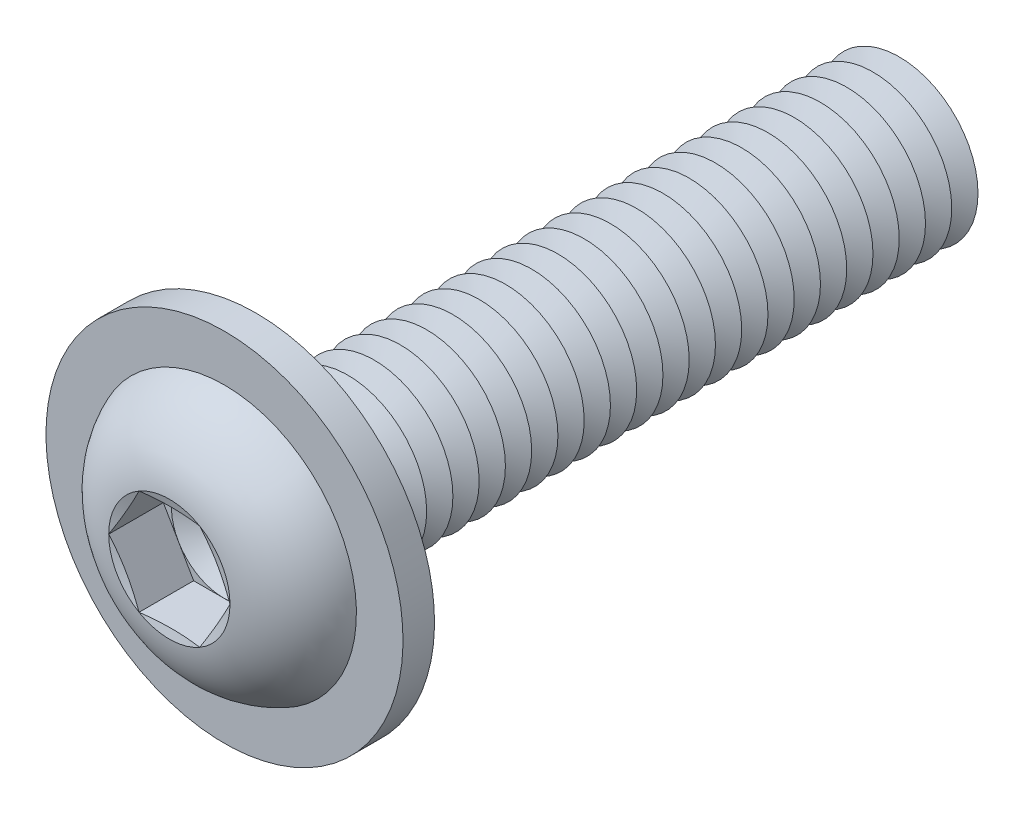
ISO-10303-21;
HEADER;
FILE_DESCRIPTION(('STEP AP214'),'2;1');
FILE_NAME('part.step','',(''),(''),'','','');
FILE_SCHEMA(('AUTOMOTIVE_DESIGN { 1 0 10303 214 1 1 1 1 }'));
ENDSEC;
DATA;
#1=APPLICATION_CONTEXT('core data for automotive mechanical design processes');
#2=APPLICATION_PROTOCOL_DEFINITION('international standard','automotive_design',2000,#1);
#3=PRODUCT_CONTEXT('',#1,'mechanical');
#4=PRODUCT('Part','Part','',(#3));
#5=PRODUCT_RELATED_PRODUCT_CATEGORY('part','',(#4));
#6=PRODUCT_DEFINITION_FORMATION('','',#4);
#7=PRODUCT_DEFINITION_CONTEXT('part definition',#1,'design');
#8=PRODUCT_DEFINITION('design','',#6,#7);
#9=PRODUCT_DEFINITION_SHAPE('','',#8);
#10=(LENGTH_UNIT() NAMED_UNIT(*) SI_UNIT(.MILLI.,.METRE.));
#11=(NAMED_UNIT(*) PLANE_ANGLE_UNIT() SI_UNIT($,.RADIAN.));
#12=(NAMED_UNIT(*) SI_UNIT($,.STERADIAN.) SOLID_ANGLE_UNIT());
#13=UNCERTAINTY_MEASURE_WITH_UNIT(LENGTH_MEASURE(1.E-05),#10,'distance_accuracy_value','');
#14=(GEOMETRIC_REPRESENTATION_CONTEXT(3) GLOBAL_UNCERTAINTY_ASSIGNED_CONTEXT((#13)) GLOBAL_UNIT_ASSIGNED_CONTEXT((#10,
#11,#12)) REPRESENTATION_CONTEXT('',''));
#15=CARTESIAN_POINT('',(0.,0.,0.));
#16=DIRECTION('',(0.,0.,1.));
#17=DIRECTION('',(1.,0.,0.));
#18=AXIS2_PLACEMENT_3D('',#15,#16,#17);
#19=CARTESIAN_POINT('',(0.,0.,-21.5));
#20=DIRECTION('',(0.,0.,1.));
#21=DIRECTION('',(1.,0.,0.));
#22=AXIS2_PLACEMENT_3D('',#19,#20,#21);
#23=CONICAL_SURFACE('',#22,3.00000000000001,1.0471975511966);
#24=CARTESIAN_POINT('',(0.,0.,-22.));
#25=DIRECTION('',(0.,0.,1.));
#26=DIRECTION('',(1.,0.,0.));
#27=AXIS2_PLACEMENT_3D('',#24,#25,#26);
#28=CIRCLE('',#27,2.13397459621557);
#29=CARTESIAN_POINT('',(2.13397459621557,0.,-22.));
#30=VERTEX_POINT('',#29);
#31=EDGE_CURVE('E411',#30,#30,#28,.T.);
#32=ORIENTED_EDGE('',*,*,#31,.T.);
#33=EDGE_LOOP('',(#32));
#34=FACE_BOUND('',#33,.T.);
#35=CARTESIAN_POINT('',(0.,0.,-21.5));
#36=DIRECTION('',(0.,0.,1.));
#37=DIRECTION('',(1.,0.,0.));
#38=AXIS2_PLACEMENT_3D('',#35,#36,#37);
#39=CIRCLE('',#38,3.00000000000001);
#40=CARTESIAN_POINT('',(3.00000000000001,0.,-21.5));
#41=VERTEX_POINT('',#40);
#42=EDGE_CURVE('E407',#41,#41,#39,.T.);
#43=ORIENTED_EDGE('',*,*,#42,.F.);
#44=EDGE_LOOP('',(#43));
#45=FACE_BOUND('',#44,.T.);
#46=ADVANCED_FACE('F39',(#34,#45),#23,.T.);
#47=CARTESIAN_POINT('',(0.,0.,-22.));
#48=DIRECTION('',(0.,0.,-1.));
#49=DIRECTION('',(-1.,0.,0.));
#50=AXIS2_PLACEMENT_3D('',#47,#48,#49);
#51=CONICAL_SURFACE('',#50,2.13397459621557,1.0471975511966);
#52=CARTESIAN_POINT('',(0.,0.,-22.5));
#53=DIRECTION('',(0.,0.,1.));
#54=DIRECTION('',(1.,0.,0.));
#55=AXIS2_PLACEMENT_3D('',#52,#53,#54);
#56=CIRCLE('',#55,3.00000000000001);
#57=CARTESIAN_POINT('',(3.00000000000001,0.,-22.5));
#58=VERTEX_POINT('',#57);
#59=EDGE_CURVE('E415',#58,#58,#56,.T.);
#60=ORIENTED_EDGE('',*,*,#59,.T.);
#61=EDGE_LOOP('',(#60));
#62=FACE_BOUND('',#61,.T.);
#63=ORIENTED_EDGE('',*,*,#31,.F.);
#64=EDGE_LOOP('',(#63));
#65=FACE_BOUND('',#64,.T.);
#66=ADVANCED_FACE('F540',(#62,#65),#51,.T.);
#67=CARTESIAN_POINT('',(0.,3.00000000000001,-25.));
#68=DIRECTION('',(0.,0.,-1.));
#69=DIRECTION('',(-1.,0.,0.));
#70=AXIS2_PLACEMENT_3D('',#67,#68,#69);
#71=PLANE('',#70);
#72=CARTESIAN_POINT('',(0.,0.,-25.));
#73=DIRECTION('',(0.,0.,1.));
#74=DIRECTION('',(1.,0.,0.));
#75=AXIS2_PLACEMENT_3D('',#72,#73,#74);
#76=CIRCLE('',#75,2.13397459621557);
#77=CARTESIAN_POINT('',(2.13397459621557,0.,-25.));
#78=VERTEX_POINT('',#77);
#79=EDGE_CURVE('E435',#78,#78,#76,.T.);
#80=ORIENTED_EDGE('',*,*,#79,.F.);
#81=EDGE_LOOP('',(#80));
#82=FACE_BOUND('',#81,.T.);
#83=ADVANCED_FACE('F546',(#82),#71,.T.);
#84=CARTESIAN_POINT('',(0.,0.,-24.5));
#85=DIRECTION('',(0.,0.,1.));
#86=DIRECTION('',(1.,0.,0.));
#87=AXIS2_PLACEMENT_3D('',#84,#85,#86);
#88=CONICAL_SURFACE('',#87,3.00000000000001,1.0471975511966);
#89=ORIENTED_EDGE('',*,*,#79,.T.);
#90=EDGE_LOOP('',(#89));
#91=FACE_BOUND('',#90,.T.);
#92=CARTESIAN_POINT('',(0.,0.,-24.5));
#93=DIRECTION('',(0.,0.,1.));
#94=DIRECTION('',(1.,0.,0.));
#95=AXIS2_PLACEMENT_3D('',#92,#93,#94);
#96=CIRCLE('',#95,3.00000000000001);
#97=CARTESIAN_POINT('',(3.00000000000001,0.,-24.5));
#98=VERTEX_POINT('',#97);
#99=EDGE_CURVE('E431',#98,#98,#96,.T.);
#100=ORIENTED_EDGE('',*,*,#99,.F.);
#101=EDGE_LOOP('',(#100));
#102=FACE_BOUND('',#101,.T.);
#103=ADVANCED_FACE('F565',(#91,#102),#88,.T.);
#104=CARTESIAN_POINT('',(0.,0.,-24.));
#105=DIRECTION('',(0.,0.,-1.));
#106=DIRECTION('',(-1.,0.,0.));
#107=AXIS2_PLACEMENT_3D('',#104,#105,#106);
#108=CONICAL_SURFACE('',#107,2.13397459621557,1.0471975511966);
#109=ORIENTED_EDGE('',*,*,#99,.T.);
#110=EDGE_LOOP('',(#109));
#111=FACE_BOUND('',#110,.T.);
#112=CARTESIAN_POINT('',(0.,0.,-24.));
#113=DIRECTION('',(0.,0.,1.));
#114=DIRECTION('',(1.,0.,0.));
#115=AXIS2_PLACEMENT_3D('',#112,#113,#114);
#116=CIRCLE('',#115,2.13397459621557);
#117=CARTESIAN_POINT('',(2.13397459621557,0.,-24.));
#118=VERTEX_POINT('',#117);
#119=EDGE_CURVE('E427',#118,#118,#116,.T.);
#120=ORIENTED_EDGE('',*,*,#119,.F.);
#121=EDGE_LOOP('',(#120));
#122=FACE_BOUND('',#121,.T.);
#123=ADVANCED_FACE('F562',(#111,#122),#108,.T.);
#124=CARTESIAN_POINT('',(0.,0.,-23.5));
#125=DIRECTION('',(0.,0.,1.));
#126=DIRECTION('',(1.,0.,0.));
#127=AXIS2_PLACEMENT_3D('',#124,#125,#126);
#128=CONICAL_SURFACE('',#127,3.00000000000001,1.0471975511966);
#129=ORIENTED_EDGE('',*,*,#119,.T.);
#130=EDGE_LOOP('',(#129));
#131=FACE_BOUND('',#130,.T.);
#132=CARTESIAN_POINT('',(0.,0.,-23.5));
#133=DIRECTION('',(0.,0.,1.));
#134=DIRECTION('',(1.,0.,0.));
#135=AXIS2_PLACEMENT_3D('',#132,#133,#134);
#136=CIRCLE('',#135,3.00000000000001);
#137=CARTESIAN_POINT('',(3.00000000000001,0.,-23.5));
#138=VERTEX_POINT('',#137);
#139=EDGE_CURVE('E423',#138,#138,#136,.T.);
#140=ORIENTED_EDGE('',*,*,#139,.F.);
#141=EDGE_LOOP('',(#140));
#142=FACE_BOUND('',#141,.T.);
#143=ADVANCED_FACE('F556',(#131,#142),#128,.T.);
#144=CARTESIAN_POINT('',(0.,0.,-23.));
#145=DIRECTION('',(0.,0.,-1.));
#146=DIRECTION('',(-1.,0.,0.));
#147=AXIS2_PLACEMENT_3D('',#144,#145,#146);
#148=CONICAL_SURFACE('',#147,2.13397459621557,1.0471975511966);
#149=ORIENTED_EDGE('',*,*,#139,.T.);
#150=EDGE_LOOP('',(#149));
#151=FACE_BOUND('',#150,.T.);
#152=CARTESIAN_POINT('',(0.,0.,-23.));
#153=DIRECTION('',(0.,0.,1.));
#154=DIRECTION('',(1.,0.,0.));
#155=AXIS2_PLACEMENT_3D('',#152,#153,#154);
#156=CIRCLE('',#155,2.13397459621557);
#157=CARTESIAN_POINT('',(2.13397459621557,0.,-23.));
#158=VERTEX_POINT('',#157);
#159=EDGE_CURVE('E419',#158,#158,#156,.T.);
#160=ORIENTED_EDGE('',*,*,#159,.F.);
#161=EDGE_LOOP('',(#160));
#162=FACE_BOUND('',#161,.T.);
#163=ADVANCED_FACE('F552',(#151,#162),#148,.T.);
#164=CARTESIAN_POINT('',(0.,0.,-22.5));
#165=DIRECTION('',(0.,0.,1.));
#166=DIRECTION('',(1.,0.,0.));
#167=AXIS2_PLACEMENT_3D('',#164,#165,#166);
#168=CONICAL_SURFACE('',#167,3.00000000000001,1.0471975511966);
#169=ORIENTED_EDGE('',*,*,#159,.T.);
#170=EDGE_LOOP('',(#169));
#171=FACE_BOUND('',#170,.T.);
#172=ORIENTED_EDGE('',*,*,#59,.F.);
#173=EDGE_LOOP('',(#172));
#174=FACE_BOUND('',#173,.T.);
#175=ADVANCED_FACE('F555',(#171,#174),#168,.T.);
#176=CARTESIAN_POINT('',(0.,0.,-20.5));
#177=DIRECTION('',(0.,0.,1.));
#178=DIRECTION('',(1.,0.,0.));
#179=AXIS2_PLACEMENT_3D('',#176,#177,#178);
#180=CONICAL_SURFACE('',#179,3.00000000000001,1.0471975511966);
#181=CARTESIAN_POINT('',(0.,0.,-21.));
#182=DIRECTION('',(0.,0.,1.));
#183=DIRECTION('',(1.,0.,0.));
#184=AXIS2_PLACEMENT_3D('',#181,#182,#183);
#185=CIRCLE('',#184,2.13397459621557);
#186=CARTESIAN_POINT('',(2.13397459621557,0.,-21.));
#187=VERTEX_POINT('',#186);
#188=EDGE_CURVE('E403',#187,#187,#185,.T.);
#189=ORIENTED_EDGE('',*,*,#188,.T.);
#190=EDGE_LOOP('',(#189));
#191=FACE_BOUND('',#190,.T.);
#192=CARTESIAN_POINT('',(0.,0.,-20.5));
#193=DIRECTION('',(0.,0.,1.));
#194=DIRECTION('',(1.,0.,0.));
#195=AXIS2_PLACEMENT_3D('',#192,#193,#194);
#196=CIRCLE('',#195,3.00000000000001);
#197=CARTESIAN_POINT('',(3.00000000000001,0.,-20.5));
#198=VERTEX_POINT('',#197);
#199=EDGE_CURVE('E399',#198,#198,#196,.T.);
#200=ORIENTED_EDGE('',*,*,#199,.F.);
#201=EDGE_LOOP('',(#200));
#202=FACE_BOUND('',#201,.T.);
#203=ADVANCED_FACE('F560',(#191,#202),#180,.T.);
#204=CARTESIAN_POINT('',(0.,0.,-21.));
#205=DIRECTION('',(0.,0.,-1.));
#206=DIRECTION('',(-1.,0.,0.));
#207=AXIS2_PLACEMENT_3D('',#204,#205,#206);
#208=CONICAL_SURFACE('',#207,2.13397459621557,1.0471975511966);
#209=ORIENTED_EDGE('',*,*,#42,.T.);
#210=EDGE_LOOP('',(#209));
#211=FACE_BOUND('',#210,.T.);
#212=ORIENTED_EDGE('',*,*,#188,.F.);
#213=EDGE_LOOP('',(#212));
#214=FACE_BOUND('',#213,.T.);
#215=ADVANCED_FACE('F611',(#211,#214),#208,.T.);
#216=CARTESIAN_POINT('',(0.,0.,-19.5));
#217=DIRECTION('',(0.,0.,1.));
#218=DIRECTION('',(1.,0.,0.));
#219=AXIS2_PLACEMENT_3D('',#216,#217,#218);
#220=CONICAL_SURFACE('',#219,3.00000000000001,1.0471975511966);
#221=CARTESIAN_POINT('',(0.,0.,-20.));
#222=DIRECTION('',(0.,0.,1.));
#223=DIRECTION('',(1.,0.,0.));
#224=AXIS2_PLACEMENT_3D('',#221,#222,#223);
#225=CIRCLE('',#224,2.13397459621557);
#226=CARTESIAN_POINT('',(2.13397459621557,0.,-20.));
#227=VERTEX_POINT('',#226);
#228=EDGE_CURVE('E395',#227,#227,#225,.T.);
#229=ORIENTED_EDGE('',*,*,#228,.T.);
#230=EDGE_LOOP('',(#229));
#231=FACE_BOUND('',#230,.T.);
#232=CARTESIAN_POINT('',(0.,0.,-19.5));
#233=DIRECTION('',(0.,0.,1.));
#234=DIRECTION('',(1.,0.,0.));
#235=AXIS2_PLACEMENT_3D('',#232,#233,#234);
#236=CIRCLE('',#235,3.00000000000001);
#237=CARTESIAN_POINT('',(3.00000000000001,0.,-19.5));
#238=VERTEX_POINT('',#237);
#239=EDGE_CURVE('E391',#238,#238,#236,.T.);
#240=ORIENTED_EDGE('',*,*,#239,.F.);
#241=EDGE_LOOP('',(#240));
#242=FACE_BOUND('',#241,.T.);
#243=ADVANCED_FACE('F617',(#231,#242),#220,.T.);
#244=CARTESIAN_POINT('',(0.,0.,-20.));
#245=DIRECTION('',(0.,0.,-1.));
#246=DIRECTION('',(-1.,0.,0.));
#247=AXIS2_PLACEMENT_3D('',#244,#245,#246);
#248=CONICAL_SURFACE('',#247,2.13397459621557,1.0471975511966);
#249=ORIENTED_EDGE('',*,*,#199,.T.);
#250=EDGE_LOOP('',(#249));
#251=FACE_BOUND('',#250,.T.);
#252=ORIENTED_EDGE('',*,*,#228,.F.);
#253=EDGE_LOOP('',(#252));
#254=FACE_BOUND('',#253,.T.);
#255=ADVANCED_FACE('F624',(#251,#254),#248,.T.);
#256=CARTESIAN_POINT('',(0.,0.,-18.5));
#257=DIRECTION('',(0.,0.,1.));
#258=DIRECTION('',(1.,0.,0.));
#259=AXIS2_PLACEMENT_3D('',#256,#257,#258);
#260=CONICAL_SURFACE('',#259,3.00000000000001,1.0471975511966);
#261=CARTESIAN_POINT('',(0.,0.,-19.));
#262=DIRECTION('',(0.,0.,1.));
#263=DIRECTION('',(1.,0.,0.));
#264=AXIS2_PLACEMENT_3D('',#261,#262,#263);
#265=CIRCLE('',#264,2.13397459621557);
#266=CARTESIAN_POINT('',(2.13397459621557,0.,-19.));
#267=VERTEX_POINT('',#266);
#268=EDGE_CURVE('E387',#267,#267,#265,.T.);
#269=ORIENTED_EDGE('',*,*,#268,.T.);
#270=EDGE_LOOP('',(#269));
#271=FACE_BOUND('',#270,.T.);
#272=CARTESIAN_POINT('',(0.,0.,-18.5));
#273=DIRECTION('',(0.,0.,1.));
#274=DIRECTION('',(1.,0.,0.));
#275=AXIS2_PLACEMENT_3D('',#272,#273,#274);
#276=CIRCLE('',#275,3.00000000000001);
#277=CARTESIAN_POINT('',(3.00000000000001,0.,-18.5));
#278=VERTEX_POINT('',#277);
#279=EDGE_CURVE('E383',#278,#278,#276,.T.);
#280=ORIENTED_EDGE('',*,*,#279,.F.);
#281=EDGE_LOOP('',(#280));
#282=FACE_BOUND('',#281,.T.);
#283=ADVANCED_FACE('F631',(#271,#282),#260,.T.);
#284=CARTESIAN_POINT('',(0.,0.,-19.));
#285=DIRECTION('',(0.,0.,-1.));
#286=DIRECTION('',(-1.,0.,0.));
#287=AXIS2_PLACEMENT_3D('',#284,#285,#286);
#288=CONICAL_SURFACE('',#287,2.13397459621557,1.0471975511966);
#289=ORIENTED_EDGE('',*,*,#239,.T.);
#290=EDGE_LOOP('',(#289));
#291=FACE_BOUND('',#290,.T.);
#292=ORIENTED_EDGE('',*,*,#268,.F.);
#293=EDGE_LOOP('',(#292));
#294=FACE_BOUND('',#293,.T.);
#295=ADVANCED_FACE('F638',(#291,#294),#288,.T.);
#296=CARTESIAN_POINT('',(0.,0.,-17.5));
#297=DIRECTION('',(0.,0.,1.));
#298=DIRECTION('',(1.,0.,0.));
#299=AXIS2_PLACEMENT_3D('',#296,#297,#298);
#300=CONICAL_SURFACE('',#299,3.00000000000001,1.0471975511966);
#301=CARTESIAN_POINT('',(0.,0.,-18.));
#302=DIRECTION('',(0.,0.,1.));
#303=DIRECTION('',(1.,0.,0.));
#304=AXIS2_PLACEMENT_3D('',#301,#302,#303);
#305=CIRCLE('',#304,2.13397459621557);
#306=CARTESIAN_POINT('',(2.13397459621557,0.,-18.));
#307=VERTEX_POINT('',#306);
#308=EDGE_CURVE('E379',#307,#307,#305,.T.);
#309=ORIENTED_EDGE('',*,*,#308,.T.);
#310=EDGE_LOOP('',(#309));
#311=FACE_BOUND('',#310,.T.);
#312=CARTESIAN_POINT('',(0.,0.,-17.5));
#313=DIRECTION('',(0.,0.,1.));
#314=DIRECTION('',(1.,0.,0.));
#315=AXIS2_PLACEMENT_3D('',#312,#313,#314);
#316=CIRCLE('',#315,3.00000000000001);
#317=CARTESIAN_POINT('',(3.00000000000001,0.,-17.5));
#318=VERTEX_POINT('',#317);
#319=EDGE_CURVE('E375',#318,#318,#316,.T.);
#320=ORIENTED_EDGE('',*,*,#319,.F.);
#321=EDGE_LOOP('',(#320));
#322=FACE_BOUND('',#321,.T.);
#323=ADVANCED_FACE('F645',(#311,#322),#300,.T.);
#324=CARTESIAN_POINT('',(0.,0.,-18.));
#325=DIRECTION('',(0.,0.,-1.));
#326=DIRECTION('',(-1.,0.,0.));
#327=AXIS2_PLACEMENT_3D('',#324,#325,#326);
#328=CONICAL_SURFACE('',#327,2.13397459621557,1.0471975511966);
#329=ORIENTED_EDGE('',*,*,#279,.T.);
#330=EDGE_LOOP('',(#329));
#331=FACE_BOUND('',#330,.T.);
#332=ORIENTED_EDGE('',*,*,#308,.F.);
#333=EDGE_LOOP('',(#332));
#334=FACE_BOUND('',#333,.T.);
#335=ADVANCED_FACE('F652',(#331,#334),#328,.T.);
#336=CARTESIAN_POINT('',(0.,0.,-16.5));
#337=DIRECTION('',(0.,0.,1.));
#338=DIRECTION('',(1.,0.,0.));
#339=AXIS2_PLACEMENT_3D('',#336,#337,#338);
#340=CONICAL_SURFACE('',#339,3.00000000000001,1.0471975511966);
#341=CARTESIAN_POINT('',(0.,0.,-17.));
#342=DIRECTION('',(0.,0.,1.));
#343=DIRECTION('',(1.,0.,0.));
#344=AXIS2_PLACEMENT_3D('',#341,#342,#343);
#345=CIRCLE('',#344,2.13397459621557);
#346=CARTESIAN_POINT('',(2.13397459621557,0.,-17.));
#347=VERTEX_POINT('',#346);
#348=EDGE_CURVE('E371',#347,#347,#345,.T.);
#349=ORIENTED_EDGE('',*,*,#348,.T.);
#350=EDGE_LOOP('',(#349));
#351=FACE_BOUND('',#350,.T.);
#352=CARTESIAN_POINT('',(0.,0.,-16.5));
#353=DIRECTION('',(0.,0.,1.));
#354=DIRECTION('',(1.,0.,0.));
#355=AXIS2_PLACEMENT_3D('',#352,#353,#354);
#356=CIRCLE('',#355,3.00000000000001);
#357=CARTESIAN_POINT('',(3.00000000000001,0.,-16.5));
#358=VERTEX_POINT('',#357);
#359=EDGE_CURVE('E367',#358,#358,#356,.T.);
#360=ORIENTED_EDGE('',*,*,#359,.F.);
#361=EDGE_LOOP('',(#360));
#362=FACE_BOUND('',#361,.T.);
#363=ADVANCED_FACE('F659',(#351,#362),#340,.T.);
#364=CARTESIAN_POINT('',(0.,0.,-17.));
#365=DIRECTION('',(0.,0.,-1.));
#366=DIRECTION('',(-1.,0.,0.));
#367=AXIS2_PLACEMENT_3D('',#364,#365,#366);
#368=CONICAL_SURFACE('',#367,2.13397459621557,1.0471975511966);
#369=ORIENTED_EDGE('',*,*,#319,.T.);
#370=EDGE_LOOP('',(#369));
#371=FACE_BOUND('',#370,.T.);
#372=ORIENTED_EDGE('',*,*,#348,.F.);
#373=EDGE_LOOP('',(#372));
#374=FACE_BOUND('',#373,.T.);
#375=ADVANCED_FACE('F666',(#371,#374),#368,.T.);
#376=CARTESIAN_POINT('',(0.,0.,-15.5));
#377=DIRECTION('',(0.,0.,1.));
#378=DIRECTION('',(1.,0.,0.));
#379=AXIS2_PLACEMENT_3D('',#376,#377,#378);
#380=CONICAL_SURFACE('',#379,3.00000000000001,1.0471975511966);
#381=CARTESIAN_POINT('',(0.,0.,-16.));
#382=DIRECTION('',(0.,0.,1.));
#383=DIRECTION('',(1.,0.,0.));
#384=AXIS2_PLACEMENT_3D('',#381,#382,#383);
#385=CIRCLE('',#384,2.13397459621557);
#386=CARTESIAN_POINT('',(2.13397459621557,0.,-16.));
#387=VERTEX_POINT('',#386);
#388=EDGE_CURVE('E363',#387,#387,#385,.T.);
#389=ORIENTED_EDGE('',*,*,#388,.T.);
#390=EDGE_LOOP('',(#389));
#391=FACE_BOUND('',#390,.T.);
#392=CARTESIAN_POINT('',(0.,0.,-15.5));
#393=DIRECTION('',(0.,0.,1.));
#394=DIRECTION('',(1.,0.,0.));
#395=AXIS2_PLACEMENT_3D('',#392,#393,#394);
#396=CIRCLE('',#395,3.00000000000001);
#397=CARTESIAN_POINT('',(3.00000000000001,0.,-15.5));
#398=VERTEX_POINT('',#397);
#399=EDGE_CURVE('E359',#398,#398,#396,.T.);
#400=ORIENTED_EDGE('',*,*,#399,.F.);
#401=EDGE_LOOP('',(#400));
#402=FACE_BOUND('',#401,.T.);
#403=ADVANCED_FACE('F673',(#391,#402),#380,.T.);
#404=CARTESIAN_POINT('',(0.,0.,-16.));
#405=DIRECTION('',(0.,0.,-1.));
#406=DIRECTION('',(-1.,0.,0.));
#407=AXIS2_PLACEMENT_3D('',#404,#405,#406);
#408=CONICAL_SURFACE('',#407,2.13397459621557,1.0471975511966);
#409=ORIENTED_EDGE('',*,*,#359,.T.);
#410=EDGE_LOOP('',(#409));
#411=FACE_BOUND('',#410,.T.);
#412=ORIENTED_EDGE('',*,*,#388,.F.);
#413=EDGE_LOOP('',(#412));
#414=FACE_BOUND('',#413,.T.);
#415=ADVANCED_FACE('F680',(#411,#414),#408,.T.);
#416=CARTESIAN_POINT('',(0.,0.,-14.5));
#417=DIRECTION('',(0.,0.,1.));
#418=DIRECTION('',(1.,0.,0.));
#419=AXIS2_PLACEMENT_3D('',#416,#417,#418);
#420=CONICAL_SURFACE('',#419,3.00000000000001,1.0471975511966);
#421=CARTESIAN_POINT('',(0.,0.,-15.));
#422=DIRECTION('',(0.,0.,1.));
#423=DIRECTION('',(1.,0.,0.));
#424=AXIS2_PLACEMENT_3D('',#421,#422,#423);
#425=CIRCLE('',#424,2.13397459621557);
#426=CARTESIAN_POINT('',(2.13397459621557,0.,-15.));
#427=VERTEX_POINT('',#426);
#428=EDGE_CURVE('E355',#427,#427,#425,.T.);
#429=ORIENTED_EDGE('',*,*,#428,.T.);
#430=EDGE_LOOP('',(#429));
#431=FACE_BOUND('',#430,.T.);
#432=CARTESIAN_POINT('',(0.,0.,-14.5));
#433=DIRECTION('',(0.,0.,1.));
#434=DIRECTION('',(1.,0.,0.));
#435=AXIS2_PLACEMENT_3D('',#432,#433,#434);
#436=CIRCLE('',#435,3.00000000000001);
#437=CARTESIAN_POINT('',(3.00000000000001,0.,-14.5));
#438=VERTEX_POINT('',#437);
#439=EDGE_CURVE('E351',#438,#438,#436,.T.);
#440=ORIENTED_EDGE('',*,*,#439,.F.);
#441=EDGE_LOOP('',(#440));
#442=FACE_BOUND('',#441,.T.);
#443=ADVANCED_FACE('F687',(#431,#442),#420,.T.);
#444=CARTESIAN_POINT('',(0.,0.,-15.));
#445=DIRECTION('',(0.,0.,-1.));
#446=DIRECTION('',(-1.,0.,0.));
#447=AXIS2_PLACEMENT_3D('',#444,#445,#446);
#448=CONICAL_SURFACE('',#447,2.13397459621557,1.0471975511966);
#449=ORIENTED_EDGE('',*,*,#399,.T.);
#450=EDGE_LOOP('',(#449));
#451=FACE_BOUND('',#450,.T.);
#452=ORIENTED_EDGE('',*,*,#428,.F.);
#453=EDGE_LOOP('',(#452));
#454=FACE_BOUND('',#453,.T.);
#455=ADVANCED_FACE('F694',(#451,#454),#448,.T.);
#456=CARTESIAN_POINT('',(0.,0.,-13.5));
#457=DIRECTION('',(0.,0.,1.));
#458=DIRECTION('',(1.,0.,0.));
#459=AXIS2_PLACEMENT_3D('',#456,#457,#458);
#460=CONICAL_SURFACE('',#459,3.00000000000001,1.0471975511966);
#461=CARTESIAN_POINT('',(0.,0.,-14.));
#462=DIRECTION('',(0.,0.,1.));
#463=DIRECTION('',(1.,0.,0.));
#464=AXIS2_PLACEMENT_3D('',#461,#462,#463);
#465=CIRCLE('',#464,2.13397459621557);
#466=CARTESIAN_POINT('',(2.13397459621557,0.,-14.));
#467=VERTEX_POINT('',#466);
#468=EDGE_CURVE('E347',#467,#467,#465,.T.);
#469=ORIENTED_EDGE('',*,*,#468,.T.);
#470=EDGE_LOOP('',(#469));
#471=FACE_BOUND('',#470,.T.);
#472=CARTESIAN_POINT('',(0.,0.,-13.5));
#473=DIRECTION('',(0.,0.,1.));
#474=DIRECTION('',(1.,0.,0.));
#475=AXIS2_PLACEMENT_3D('',#472,#473,#474);
#476=CIRCLE('',#475,3.00000000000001);
#477=CARTESIAN_POINT('',(3.00000000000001,0.,-13.5));
#478=VERTEX_POINT('',#477);
#479=EDGE_CURVE('E343',#478,#478,#476,.T.);
#480=ORIENTED_EDGE('',*,*,#479,.F.);
#481=EDGE_LOOP('',(#480));
#482=FACE_BOUND('',#481,.T.);
#483=ADVANCED_FACE('F701',(#471,#482),#460,.T.);
#484=CARTESIAN_POINT('',(0.,0.,-14.));
#485=DIRECTION('',(0.,0.,-1.));
#486=DIRECTION('',(-1.,0.,0.));
#487=AXIS2_PLACEMENT_3D('',#484,#485,#486);
#488=CONICAL_SURFACE('',#487,2.13397459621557,1.0471975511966);
#489=ORIENTED_EDGE('',*,*,#439,.T.);
#490=EDGE_LOOP('',(#489));
#491=FACE_BOUND('',#490,.T.);
#492=ORIENTED_EDGE('',*,*,#468,.F.);
#493=EDGE_LOOP('',(#492));
#494=FACE_BOUND('',#493,.T.);
#495=ADVANCED_FACE('F708',(#491,#494),#488,.T.);
#496=CARTESIAN_POINT('',(0.,0.,-12.5));
#497=DIRECTION('',(0.,0.,1.));
#498=DIRECTION('',(1.,0.,0.));
#499=AXIS2_PLACEMENT_3D('',#496,#497,#498);
#500=CONICAL_SURFACE('',#499,3.00000000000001,1.0471975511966);
#501=CARTESIAN_POINT('',(0.,0.,-13.));
#502=DIRECTION('',(0.,0.,1.));
#503=DIRECTION('',(1.,0.,0.));
#504=AXIS2_PLACEMENT_3D('',#501,#502,#503);
#505=CIRCLE('',#504,2.13397459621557);
#506=CARTESIAN_POINT('',(2.13397459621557,0.,-13.));
#507=VERTEX_POINT('',#506);
#508=EDGE_CURVE('E339',#507,#507,#505,.T.);
#509=ORIENTED_EDGE('',*,*,#508,.T.);
#510=EDGE_LOOP('',(#509));
#511=FACE_BOUND('',#510,.T.);
#512=CARTESIAN_POINT('',(0.,0.,-12.5));
#513=DIRECTION('',(0.,0.,1.));
#514=DIRECTION('',(1.,0.,0.));
#515=AXIS2_PLACEMENT_3D('',#512,#513,#514);
#516=CIRCLE('',#515,3.00000000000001);
#517=CARTESIAN_POINT('',(3.00000000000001,0.,-12.5));
#518=VERTEX_POINT('',#517);
#519=EDGE_CURVE('E335',#518,#518,#516,.T.);
#520=ORIENTED_EDGE('',*,*,#519,.F.);
#521=EDGE_LOOP('',(#520));
#522=FACE_BOUND('',#521,.T.);
#523=ADVANCED_FACE('F715',(#511,#522),#500,.T.);
#524=CARTESIAN_POINT('',(0.,0.,-13.));
#525=DIRECTION('',(0.,0.,-1.));
#526=DIRECTION('',(-1.,0.,0.));
#527=AXIS2_PLACEMENT_3D('',#524,#525,#526);
#528=CONICAL_SURFACE('',#527,2.13397459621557,1.0471975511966);
#529=ORIENTED_EDGE('',*,*,#479,.T.);
#530=EDGE_LOOP('',(#529));
#531=FACE_BOUND('',#530,.T.);
#532=ORIENTED_EDGE('',*,*,#508,.F.);
#533=EDGE_LOOP('',(#532));
#534=FACE_BOUND('',#533,.T.);
#535=ADVANCED_FACE('F722',(#531,#534),#528,.T.);
#536=CARTESIAN_POINT('',(0.,0.,-11.5));
#537=DIRECTION('',(0.,0.,1.));
#538=DIRECTION('',(1.,0.,0.));
#539=AXIS2_PLACEMENT_3D('',#536,#537,#538);
#540=CONICAL_SURFACE('',#539,3.00000000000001,1.0471975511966);
#541=CARTESIAN_POINT('',(0.,0.,-12.));
#542=DIRECTION('',(0.,0.,1.));
#543=DIRECTION('',(1.,0.,0.));
#544=AXIS2_PLACEMENT_3D('',#541,#542,#543);
#545=CIRCLE('',#544,2.13397459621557);
#546=CARTESIAN_POINT('',(2.13397459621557,0.,-12.));
#547=VERTEX_POINT('',#546);
#548=EDGE_CURVE('E331',#547,#547,#545,.T.);
#549=ORIENTED_EDGE('',*,*,#548,.T.);
#550=EDGE_LOOP('',(#549));
#551=FACE_BOUND('',#550,.T.);
#552=CARTESIAN_POINT('',(0.,0.,-11.5));
#553=DIRECTION('',(0.,0.,1.));
#554=DIRECTION('',(1.,0.,0.));
#555=AXIS2_PLACEMENT_3D('',#552,#553,#554);
#556=CIRCLE('',#555,3.00000000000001);
#557=CARTESIAN_POINT('',(3.00000000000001,0.,-11.5));
#558=VERTEX_POINT('',#557);
#559=EDGE_CURVE('E327',#558,#558,#556,.T.);
#560=ORIENTED_EDGE('',*,*,#559,.F.);
#561=EDGE_LOOP('',(#560));
#562=FACE_BOUND('',#561,.T.);
#563=ADVANCED_FACE('F729',(#551,#562),#540,.T.);
#564=CARTESIAN_POINT('',(0.,0.,-12.));
#565=DIRECTION('',(0.,0.,-1.));
#566=DIRECTION('',(-1.,0.,0.));
#567=AXIS2_PLACEMENT_3D('',#564,#565,#566);
#568=CONICAL_SURFACE('',#567,2.13397459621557,1.0471975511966);
#569=ORIENTED_EDGE('',*,*,#519,.T.);
#570=EDGE_LOOP('',(#569));
#571=FACE_BOUND('',#570,.T.);
#572=ORIENTED_EDGE('',*,*,#548,.F.);
#573=EDGE_LOOP('',(#572));
#574=FACE_BOUND('',#573,.T.);
#575=ADVANCED_FACE('F736',(#571,#574),#568,.T.);
#576=CARTESIAN_POINT('',(0.,0.,-10.5));
#577=DIRECTION('',(0.,0.,1.));
#578=DIRECTION('',(1.,0.,0.));
#579=AXIS2_PLACEMENT_3D('',#576,#577,#578);
#580=CONICAL_SURFACE('',#579,3.00000000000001,1.0471975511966);
#581=CARTESIAN_POINT('',(0.,0.,-11.));
#582=DIRECTION('',(0.,0.,1.));
#583=DIRECTION('',(1.,0.,0.));
#584=AXIS2_PLACEMENT_3D('',#581,#582,#583);
#585=CIRCLE('',#584,2.13397459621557);
#586=CARTESIAN_POINT('',(2.13397459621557,0.,-11.));
#587=VERTEX_POINT('',#586);
#588=EDGE_CURVE('E323',#587,#587,#585,.T.);
#589=ORIENTED_EDGE('',*,*,#588,.T.);
#590=EDGE_LOOP('',(#589));
#591=FACE_BOUND('',#590,.T.);
#592=CARTESIAN_POINT('',(0.,0.,-10.5));
#593=DIRECTION('',(0.,0.,1.));
#594=DIRECTION('',(1.,0.,0.));
#595=AXIS2_PLACEMENT_3D('',#592,#593,#594);
#596=CIRCLE('',#595,3.00000000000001);
#597=CARTESIAN_POINT('',(3.00000000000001,0.,-10.5));
#598=VERTEX_POINT('',#597);
#599=EDGE_CURVE('E319',#598,#598,#596,.T.);
#600=ORIENTED_EDGE('',*,*,#599,.F.);
#601=EDGE_LOOP('',(#600));
#602=FACE_BOUND('',#601,.T.);
#603=ADVANCED_FACE('F743',(#591,#602),#580,.T.);
#604=CARTESIAN_POINT('',(0.,0.,-11.));
#605=DIRECTION('',(0.,0.,-1.));
#606=DIRECTION('',(-1.,0.,0.));
#607=AXIS2_PLACEMENT_3D('',#604,#605,#606);
#608=CONICAL_SURFACE('',#607,2.13397459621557,1.0471975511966);
#609=ORIENTED_EDGE('',*,*,#559,.T.);
#610=EDGE_LOOP('',(#609));
#611=FACE_BOUND('',#610,.T.);
#612=ORIENTED_EDGE('',*,*,#588,.F.);
#613=EDGE_LOOP('',(#612));
#614=FACE_BOUND('',#613,.T.);
#615=ADVANCED_FACE('F750',(#611,#614),#608,.T.);
#616=CARTESIAN_POINT('',(0.,0.,-9.5));
#617=DIRECTION('',(0.,0.,1.));
#618=DIRECTION('',(1.,0.,0.));
#619=AXIS2_PLACEMENT_3D('',#616,#617,#618);
#620=CONICAL_SURFACE('',#619,3.00000000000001,1.0471975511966);
#621=CARTESIAN_POINT('',(0.,0.,-10.));
#622=DIRECTION('',(0.,0.,1.));
#623=DIRECTION('',(1.,0.,0.));
#624=AXIS2_PLACEMENT_3D('',#621,#622,#623);
#625=CIRCLE('',#624,2.13397459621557);
#626=CARTESIAN_POINT('',(2.13397459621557,0.,-10.));
#627=VERTEX_POINT('',#626);
#628=EDGE_CURVE('E315',#627,#627,#625,.T.);
#629=ORIENTED_EDGE('',*,*,#628,.T.);
#630=EDGE_LOOP('',(#629));
#631=FACE_BOUND('',#630,.T.);
#632=CARTESIAN_POINT('',(0.,0.,-9.5));
#633=DIRECTION('',(0.,0.,1.));
#634=DIRECTION('',(1.,0.,0.));
#635=AXIS2_PLACEMENT_3D('',#632,#633,#634);
#636=CIRCLE('',#635,3.00000000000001);
#637=CARTESIAN_POINT('',(3.00000000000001,0.,-9.5));
#638=VERTEX_POINT('',#637);
#639=EDGE_CURVE('E311',#638,#638,#636,.T.);
#640=ORIENTED_EDGE('',*,*,#639,.F.);
#641=EDGE_LOOP('',(#640));
#642=FACE_BOUND('',#641,.T.);
#643=ADVANCED_FACE('F757',(#631,#642),#620,.T.);
#644=CARTESIAN_POINT('',(0.,0.,-10.));
#645=DIRECTION('',(0.,0.,-1.));
#646=DIRECTION('',(-1.,0.,0.));
#647=AXIS2_PLACEMENT_3D('',#644,#645,#646);
#648=CONICAL_SURFACE('',#647,2.13397459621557,1.0471975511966);
#649=ORIENTED_EDGE('',*,*,#599,.T.);
#650=EDGE_LOOP('',(#649));
#651=FACE_BOUND('',#650,.T.);
#652=ORIENTED_EDGE('',*,*,#628,.F.);
#653=EDGE_LOOP('',(#652));
#654=FACE_BOUND('',#653,.T.);
#655=ADVANCED_FACE('F764',(#651,#654),#648,.T.);
#656=CARTESIAN_POINT('',(0.,0.,-8.5));
#657=DIRECTION('',(0.,0.,1.));
#658=DIRECTION('',(1.,0.,0.));
#659=AXIS2_PLACEMENT_3D('',#656,#657,#658);
#660=CONICAL_SURFACE('',#659,3.00000000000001,1.0471975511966);
#661=CARTESIAN_POINT('',(0.,0.,-9.));
#662=DIRECTION('',(0.,0.,1.));
#663=DIRECTION('',(1.,0.,0.));
#664=AXIS2_PLACEMENT_3D('',#661,#662,#663);
#665=CIRCLE('',#664,2.13397459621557);
#666=CARTESIAN_POINT('',(2.13397459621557,0.,-9.));
#667=VERTEX_POINT('',#666);
#668=EDGE_CURVE('E307',#667,#667,#665,.T.);
#669=ORIENTED_EDGE('',*,*,#668,.T.);
#670=EDGE_LOOP('',(#669));
#671=FACE_BOUND('',#670,.T.);
#672=CARTESIAN_POINT('',(0.,0.,-8.5));
#673=DIRECTION('',(0.,0.,1.));
#674=DIRECTION('',(1.,0.,0.));
#675=AXIS2_PLACEMENT_3D('',#672,#673,#674);
#676=CIRCLE('',#675,3.00000000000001);
#677=CARTESIAN_POINT('',(3.00000000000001,0.,-8.5));
#678=VERTEX_POINT('',#677);
#679=EDGE_CURVE('E303',#678,#678,#676,.T.);
#680=ORIENTED_EDGE('',*,*,#679,.F.);
#681=EDGE_LOOP('',(#680));
#682=FACE_BOUND('',#681,.T.);
#683=ADVANCED_FACE('F771',(#671,#682),#660,.T.);
#684=CARTESIAN_POINT('',(0.,0.,-9.));
#685=DIRECTION('',(0.,0.,-1.));
#686=DIRECTION('',(-1.,0.,0.));
#687=AXIS2_PLACEMENT_3D('',#684,#685,#686);
#688=CONICAL_SURFACE('',#687,2.13397459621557,1.0471975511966);
#689=ORIENTED_EDGE('',*,*,#639,.T.);
#690=EDGE_LOOP('',(#689));
#691=FACE_BOUND('',#690,.T.);
#692=ORIENTED_EDGE('',*,*,#668,.F.);
#693=EDGE_LOOP('',(#692));
#694=FACE_BOUND('',#693,.T.);
#695=ADVANCED_FACE('F778',(#691,#694),#688,.T.);
#696=CARTESIAN_POINT('',(0.,0.,-7.5));
#697=DIRECTION('',(0.,0.,1.));
#698=DIRECTION('',(1.,0.,0.));
#699=AXIS2_PLACEMENT_3D('',#696,#697,#698);
#700=CONICAL_SURFACE('',#699,3.00000000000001,1.0471975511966);
#701=CARTESIAN_POINT('',(0.,0.,-8.));
#702=DIRECTION('',(0.,0.,1.));
#703=DIRECTION('',(1.,0.,0.));
#704=AXIS2_PLACEMENT_3D('',#701,#702,#703);
#705=CIRCLE('',#704,2.13397459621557);
#706=CARTESIAN_POINT('',(2.13397459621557,0.,-8.));
#707=VERTEX_POINT('',#706);
#708=EDGE_CURVE('E299',#707,#707,#705,.T.);
#709=ORIENTED_EDGE('',*,*,#708,.T.);
#710=EDGE_LOOP('',(#709));
#711=FACE_BOUND('',#710,.T.);
#712=CARTESIAN_POINT('',(0.,0.,-7.5));
#713=DIRECTION('',(0.,0.,1.));
#714=DIRECTION('',(1.,0.,0.));
#715=AXIS2_PLACEMENT_3D('',#712,#713,#714);
#716=CIRCLE('',#715,3.00000000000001);
#717=CARTESIAN_POINT('',(3.00000000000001,0.,-7.5));
#718=VERTEX_POINT('',#717);
#719=EDGE_CURVE('E295',#718,#718,#716,.T.);
#720=ORIENTED_EDGE('',*,*,#719,.F.);
#721=EDGE_LOOP('',(#720));
#722=FACE_BOUND('',#721,.T.);
#723=ADVANCED_FACE('F785',(#711,#722),#700,.T.);
#724=CARTESIAN_POINT('',(0.,0.,-8.));
#725=DIRECTION('',(0.,0.,-1.));
#726=DIRECTION('',(-1.,0.,0.));
#727=AXIS2_PLACEMENT_3D('',#724,#725,#726);
#728=CONICAL_SURFACE('',#727,2.13397459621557,1.0471975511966);
#729=ORIENTED_EDGE('',*,*,#679,.T.);
#730=EDGE_LOOP('',(#729));
#731=FACE_BOUND('',#730,.T.);
#732=ORIENTED_EDGE('',*,*,#708,.F.);
#733=EDGE_LOOP('',(#732));
#734=FACE_BOUND('',#733,.T.);
#735=ADVANCED_FACE('F792',(#731,#734),#728,.T.);
#736=CARTESIAN_POINT('',(0.,0.,-6.5));
#737=DIRECTION('',(0.,0.,1.));
#738=DIRECTION('',(1.,0.,0.));
#739=AXIS2_PLACEMENT_3D('',#736,#737,#738);
#740=CONICAL_SURFACE('',#739,3.00000000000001,1.0471975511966);
#741=CARTESIAN_POINT('',(0.,0.,-7.));
#742=DIRECTION('',(0.,0.,1.));
#743=DIRECTION('',(1.,0.,0.));
#744=AXIS2_PLACEMENT_3D('',#741,#742,#743);
#745=CIRCLE('',#744,2.13397459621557);
#746=CARTESIAN_POINT('',(2.13397459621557,0.,-7.));
#747=VERTEX_POINT('',#746);
#748=EDGE_CURVE('E291',#747,#747,#745,.T.);
#749=ORIENTED_EDGE('',*,*,#748,.T.);
#750=EDGE_LOOP('',(#749));
#751=FACE_BOUND('',#750,.T.);
#752=CARTESIAN_POINT('',(0.,0.,-6.5));
#753=DIRECTION('',(0.,0.,1.));
#754=DIRECTION('',(1.,0.,0.));
#755=AXIS2_PLACEMENT_3D('',#752,#753,#754);
#756=CIRCLE('',#755,3.00000000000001);
#757=CARTESIAN_POINT('',(3.00000000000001,0.,-6.5));
#758=VERTEX_POINT('',#757);
#759=EDGE_CURVE('E287',#758,#758,#756,.T.);
#760=ORIENTED_EDGE('',*,*,#759,.F.);
#761=EDGE_LOOP('',(#760));
#762=FACE_BOUND('',#761,.T.);
#763=ADVANCED_FACE('F799',(#751,#762),#740,.T.);
#764=CARTESIAN_POINT('',(0.,0.,-7.));
#765=DIRECTION('',(0.,0.,-1.));
#766=DIRECTION('',(-1.,0.,0.));
#767=AXIS2_PLACEMENT_3D('',#764,#765,#766);
#768=CONICAL_SURFACE('',#767,2.13397459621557,1.0471975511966);
#769=ORIENTED_EDGE('',*,*,#719,.T.);
#770=EDGE_LOOP('',(#769));
#771=FACE_BOUND('',#770,.T.);
#772=ORIENTED_EDGE('',*,*,#748,.F.);
#773=EDGE_LOOP('',(#772));
#774=FACE_BOUND('',#773,.T.);
#775=ADVANCED_FACE('F806',(#771,#774),#768,.T.);
#776=CARTESIAN_POINT('',(0.,0.,-5.5));
#777=DIRECTION('',(0.,0.,1.));
#778=DIRECTION('',(1.,0.,0.));
#779=AXIS2_PLACEMENT_3D('',#776,#777,#778);
#780=CONICAL_SURFACE('',#779,3.00000000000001,1.0471975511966);
#781=CARTESIAN_POINT('',(0.,0.,-6.));
#782=DIRECTION('',(0.,0.,1.));
#783=DIRECTION('',(1.,0.,0.));
#784=AXIS2_PLACEMENT_3D('',#781,#782,#783);
#785=CIRCLE('',#784,2.13397459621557);
#786=CARTESIAN_POINT('',(2.13397459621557,0.,-6.));
#787=VERTEX_POINT('',#786);
#788=EDGE_CURVE('E283',#787,#787,#785,.T.);
#789=ORIENTED_EDGE('',*,*,#788,.T.);
#790=EDGE_LOOP('',(#789));
#791=FACE_BOUND('',#790,.T.);
#792=CARTESIAN_POINT('',(0.,0.,-5.5));
#793=DIRECTION('',(0.,0.,1.));
#794=DIRECTION('',(1.,0.,0.));
#795=AXIS2_PLACEMENT_3D('',#792,#793,#794);
#796=CIRCLE('',#795,3.00000000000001);
#797=CARTESIAN_POINT('',(3.00000000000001,0.,-5.5));
#798=VERTEX_POINT('',#797);
#799=EDGE_CURVE('E279',#798,#798,#796,.T.);
#800=ORIENTED_EDGE('',*,*,#799,.F.);
#801=EDGE_LOOP('',(#800));
#802=FACE_BOUND('',#801,.T.);
#803=ADVANCED_FACE('F813',(#791,#802),#780,.T.);
#804=CARTESIAN_POINT('',(0.,0.,-6.));
#805=DIRECTION('',(0.,0.,-1.));
#806=DIRECTION('',(-1.,0.,0.));
#807=AXIS2_PLACEMENT_3D('',#804,#805,#806);
#808=CONICAL_SURFACE('',#807,2.13397459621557,1.0471975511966);
#809=ORIENTED_EDGE('',*,*,#759,.T.);
#810=EDGE_LOOP('',(#809));
#811=FACE_BOUND('',#810,.T.);
#812=ORIENTED_EDGE('',*,*,#788,.F.);
#813=EDGE_LOOP('',(#812));
#814=FACE_BOUND('',#813,.T.);
#815=ADVANCED_FACE('F820',(#811,#814),#808,.T.);
#816=CARTESIAN_POINT('',(0.,0.,-4.5));
#817=DIRECTION('',(0.,0.,1.));
#818=DIRECTION('',(1.,0.,0.));
#819=AXIS2_PLACEMENT_3D('',#816,#817,#818);
#820=CONICAL_SURFACE('',#819,3.00000000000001,1.0471975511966);
#821=CARTESIAN_POINT('',(0.,0.,-5.));
#822=DIRECTION('',(0.,0.,1.));
#823=DIRECTION('',(1.,0.,0.));
#824=AXIS2_PLACEMENT_3D('',#821,#822,#823);
#825=CIRCLE('',#824,2.13397459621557);
#826=CARTESIAN_POINT('',(2.13397459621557,0.,-5.));
#827=VERTEX_POINT('',#826);
#828=EDGE_CURVE('E275',#827,#827,#825,.T.);
#829=ORIENTED_EDGE('',*,*,#828,.T.);
#830=EDGE_LOOP('',(#829));
#831=FACE_BOUND('',#830,.T.);
#832=CARTESIAN_POINT('',(0.,0.,-4.5));
#833=DIRECTION('',(0.,0.,1.));
#834=DIRECTION('',(1.,0.,0.));
#835=AXIS2_PLACEMENT_3D('',#832,#833,#834);
#836=CIRCLE('',#835,3.00000000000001);
#837=CARTESIAN_POINT('',(3.00000000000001,0.,-4.5));
#838=VERTEX_POINT('',#837);
#839=EDGE_CURVE('E271',#838,#838,#836,.T.);
#840=ORIENTED_EDGE('',*,*,#839,.F.);
#841=EDGE_LOOP('',(#840));
#842=FACE_BOUND('',#841,.T.);
#843=ADVANCED_FACE('F827',(#831,#842),#820,.T.);
#844=CARTESIAN_POINT('',(0.,0.,-5.));
#845=DIRECTION('',(0.,0.,-1.));
#846=DIRECTION('',(-1.,0.,0.));
#847=AXIS2_PLACEMENT_3D('',#844,#845,#846);
#848=CONICAL_SURFACE('',#847,2.13397459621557,1.0471975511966);
#849=ORIENTED_EDGE('',*,*,#799,.T.);
#850=EDGE_LOOP('',(#849));
#851=FACE_BOUND('',#850,.T.);
#852=ORIENTED_EDGE('',*,*,#828,.F.);
#853=EDGE_LOOP('',(#852));
#854=FACE_BOUND('',#853,.T.);
#855=ADVANCED_FACE('F834',(#851,#854),#848,.T.);
#856=CARTESIAN_POINT('',(0.,0.,-3.5));
#857=DIRECTION('',(0.,0.,1.));
#858=DIRECTION('',(1.,0.,0.));
#859=AXIS2_PLACEMENT_3D('',#856,#857,#858);
#860=CONICAL_SURFACE('',#859,3.00000000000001,1.0471975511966);
#861=CARTESIAN_POINT('',(0.,0.,-4.));
#862=DIRECTION('',(0.,0.,1.));
#863=DIRECTION('',(1.,0.,0.));
#864=AXIS2_PLACEMENT_3D('',#861,#862,#863);
#865=CIRCLE('',#864,2.13397459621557);
#866=CARTESIAN_POINT('',(2.13397459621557,0.,-4.));
#867=VERTEX_POINT('',#866);
#868=EDGE_CURVE('E267',#867,#867,#865,.T.);
#869=ORIENTED_EDGE('',*,*,#868,.T.);
#870=EDGE_LOOP('',(#869));
#871=FACE_BOUND('',#870,.T.);
#872=CARTESIAN_POINT('',(0.,0.,-3.5));
#873=DIRECTION('',(0.,0.,1.));
#874=DIRECTION('',(1.,0.,0.));
#875=AXIS2_PLACEMENT_3D('',#872,#873,#874);
#876=CIRCLE('',#875,3.00000000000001);
#877=CARTESIAN_POINT('',(3.00000000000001,0.,-3.5));
#878=VERTEX_POINT('',#877);
#879=EDGE_CURVE('E263',#878,#878,#876,.T.);
#880=ORIENTED_EDGE('',*,*,#879,.F.);
#881=EDGE_LOOP('',(#880));
#882=FACE_BOUND('',#881,.T.);
#883=ADVANCED_FACE('F841',(#871,#882),#860,.T.);
#884=CARTESIAN_POINT('',(0.,0.,-4.));
#885=DIRECTION('',(0.,0.,-1.));
#886=DIRECTION('',(-1.,0.,0.));
#887=AXIS2_PLACEMENT_3D('',#884,#885,#886);
#888=CONICAL_SURFACE('',#887,2.13397459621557,1.0471975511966);
#889=ORIENTED_EDGE('',*,*,#839,.T.);
#890=EDGE_LOOP('',(#889));
#891=FACE_BOUND('',#890,.T.);
#892=ORIENTED_EDGE('',*,*,#868,.F.);
#893=EDGE_LOOP('',(#892));
#894=FACE_BOUND('',#893,.T.);
#895=ADVANCED_FACE('F848',(#891,#894),#888,.T.);
#896=CARTESIAN_POINT('',(0.,0.,-2.5));
#897=DIRECTION('',(0.,0.,1.));
#898=DIRECTION('',(1.,0.,0.));
#899=AXIS2_PLACEMENT_3D('',#896,#897,#898);
#900=CONICAL_SURFACE('',#899,3.00000000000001,1.0471975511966);
#901=CARTESIAN_POINT('',(0.,0.,-3.));
#902=DIRECTION('',(0.,0.,1.));
#903=DIRECTION('',(1.,0.,0.));
#904=AXIS2_PLACEMENT_3D('',#901,#902,#903);
#905=CIRCLE('',#904,2.13397459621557);
#906=CARTESIAN_POINT('',(2.13397459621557,0.,-3.));
#907=VERTEX_POINT('',#906);
#908=EDGE_CURVE('E259',#907,#907,#905,.T.);
#909=ORIENTED_EDGE('',*,*,#908,.T.);
#910=EDGE_LOOP('',(#909));
#911=FACE_BOUND('',#910,.T.);
#912=CARTESIAN_POINT('',(0.,0.,-2.5));
#913=DIRECTION('',(0.,0.,1.));
#914=DIRECTION('',(1.,0.,0.));
#915=AXIS2_PLACEMENT_3D('',#912,#913,#914);
#916=CIRCLE('',#915,3.00000000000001);
#917=CARTESIAN_POINT('',(3.00000000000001,0.,-2.5));
#918=VERTEX_POINT('',#917);
#919=EDGE_CURVE('E255',#918,#918,#916,.T.);
#920=ORIENTED_EDGE('',*,*,#919,.F.);
#921=EDGE_LOOP('',(#920));
#922=FACE_BOUND('',#921,.T.);
#923=ADVANCED_FACE('F855',(#911,#922),#900,.T.);
#924=CARTESIAN_POINT('',(0.,0.,-3.));
#925=DIRECTION('',(0.,0.,-1.));
#926=DIRECTION('',(-1.,0.,0.));
#927=AXIS2_PLACEMENT_3D('',#924,#925,#926);
#928=CONICAL_SURFACE('',#927,2.13397459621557,1.0471975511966);
#929=ORIENTED_EDGE('',*,*,#879,.T.);
#930=EDGE_LOOP('',(#929));
#931=FACE_BOUND('',#930,.T.);
#932=ORIENTED_EDGE('',*,*,#908,.F.);
#933=EDGE_LOOP('',(#932));
#934=FACE_BOUND('',#933,.T.);
#935=ADVANCED_FACE('F862',(#931,#934),#928,.T.);
#936=CARTESIAN_POINT('',(0.,0.,-1.5));
#937=DIRECTION('',(0.,0.,1.));
#938=DIRECTION('',(1.,0.,0.));
#939=AXIS2_PLACEMENT_3D('',#936,#937,#938);
#940=CONICAL_SURFACE('',#939,3.00000000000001,1.0471975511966);
#941=CARTESIAN_POINT('',(0.,0.,-2.));
#942=DIRECTION('',(0.,0.,1.));
#943=DIRECTION('',(1.,0.,0.));
#944=AXIS2_PLACEMENT_3D('',#941,#942,#943);
#945=CIRCLE('',#944,2.13397459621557);
#946=CARTESIAN_POINT('',(2.13397459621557,0.,-2.));
#947=VERTEX_POINT('',#946);
#948=EDGE_CURVE('E251',#947,#947,#945,.T.);
#949=ORIENTED_EDGE('',*,*,#948,.T.);
#950=EDGE_LOOP('',(#949));
#951=FACE_BOUND('',#950,.T.);
#952=CARTESIAN_POINT('',(0.,0.,-1.5));
#953=DIRECTION('',(0.,0.,1.));
#954=DIRECTION('',(1.,0.,0.));
#955=AXIS2_PLACEMENT_3D('',#952,#953,#954);
#956=CIRCLE('',#955,3.00000000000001);
#957=CARTESIAN_POINT('',(3.00000000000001,0.,-1.5));
#958=VERTEX_POINT('',#957);
#959=EDGE_CURVE('E243',#958,#958,#956,.T.);
#960=ORIENTED_EDGE('',*,*,#959,.F.);
#961=EDGE_LOOP('',(#960));
#962=FACE_BOUND('',#961,.T.);
#963=ADVANCED_FACE('F869',(#951,#962),#940,.T.);
#964=CARTESIAN_POINT('',(0.,0.,-2.));
#965=DIRECTION('',(0.,0.,-1.));
#966=DIRECTION('',(-1.,0.,0.));
#967=AXIS2_PLACEMENT_3D('',#964,#965,#966);
#968=CONICAL_SURFACE('',#967,2.13397459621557,1.0471975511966);
#969=ORIENTED_EDGE('',*,*,#919,.T.);
#970=EDGE_LOOP('',(#969));
#971=FACE_BOUND('',#970,.T.);
#972=ORIENTED_EDGE('',*,*,#948,.F.);
#973=EDGE_LOOP('',(#972));
#974=FACE_BOUND('',#973,.T.);
#975=ADVANCED_FACE('F876',(#971,#974),#968,.T.);
#976=CARTESIAN_POINT('',(0.,0.,-0.5));
#977=DIRECTION('',(0.,0.,1.));
#978=DIRECTION('',(1.,0.,0.));
#979=AXIS2_PLACEMENT_3D('',#976,#977,#978);
#980=CONICAL_SURFACE('',#979,3.00000000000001,1.0471975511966);
#981=CARTESIAN_POINT('',(0.,0.,-1.));
#982=DIRECTION('',(0.,0.,1.));
#983=DIRECTION('',(1.,0.,0.));
#984=AXIS2_PLACEMENT_3D('',#981,#982,#983);
#985=CIRCLE('',#984,2.13397459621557);
#986=CARTESIAN_POINT('',(2.13397459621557,0.,-1.));
#987=VERTEX_POINT('',#986);
#988=EDGE_CURVE('E232',#987,#987,#985,.T.);
#989=ORIENTED_EDGE('',*,*,#988,.T.);
#990=EDGE_LOOP('',(#989));
#991=FACE_BOUND('',#990,.T.);
#992=CARTESIAN_POINT('',(0.,0.,-0.5));
#993=DIRECTION('',(0.,0.,1.));
#994=DIRECTION('',(1.,0.,0.));
#995=AXIS2_PLACEMENT_3D('',#992,#993,#994);
#996=CIRCLE('',#995,3.00000000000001);
#997=CARTESIAN_POINT('',(3.00000000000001,0.,-0.5));
#998=VERTEX_POINT('',#997);
#999=EDGE_CURVE('E247',#998,#998,#996,.T.);
#1000=ORIENTED_EDGE('',*,*,#999,.F.);
#1001=EDGE_LOOP('',(#1000));
#1002=FACE_BOUND('',#1001,.T.);
#1003=ADVANCED_FACE('F883',(#991,#1002),#980,.T.);
#1004=CARTESIAN_POINT('',(0.,0.,-1.));
#1005=DIRECTION('',(0.,0.,-1.));
#1006=DIRECTION('',(-1.,0.,0.));
#1007=AXIS2_PLACEMENT_3D('',#1004,#1005,#1006);
#1008=CONICAL_SURFACE('',#1007,2.13397459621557,1.0471975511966);
#1009=ORIENTED_EDGE('',*,*,#959,.T.);
#1010=EDGE_LOOP('',(#1009));
#1011=FACE_BOUND('',#1010,.T.);
#1012=ORIENTED_EDGE('',*,*,#988,.F.);
#1013=EDGE_LOOP('',(#1012));
#1014=FACE_BOUND('',#1013,.T.);
#1015=ADVANCED_FACE('F221',(#1011,#1014),#1008,.T.);
#1016=CARTESIAN_POINT('',(0.,3.,0.));
#1017=DIRECTION('',(0.,0.,-1.));
#1018=DIRECTION('',(-1.,0.,0.));
#1019=AXIS2_PLACEMENT_3D('',#1016,#1017,#1018);
#1020=PLANE('',#1019);
#1021=CARTESIAN_POINT('',(0.,0.,0.));
#1022=DIRECTION('',(0.,0.,-1.));
#1023=DIRECTION('',(-1.,0.,0.));
#1024=AXIS2_PLACEMENT_3D('',#1021,#1022,#1023);
#1025=CIRCLE('',#1024,3.50000000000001);
#1026=CARTESIAN_POINT('',(-3.50000000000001,0.,0.));
#1027=VERTEX_POINT('',#1026);
#1028=EDGE_CURVE('E443',#1027,#1027,#1025,.F.);
#1029=ORIENTED_EDGE('',*,*,#1028,.T.);
#1030=EDGE_LOOP('',(#1029));
#1031=FACE_BOUND('',#1030,.T.);
#1032=CARTESIAN_POINT('',(0.,0.,0.));
#1033=DIRECTION('',(0.,0.,-1.));
#1034=DIRECTION('',(0.,1.,0.));
#1035=AXIS2_PLACEMENT_3D('',#1032,#1033,#1034);
#1036=CIRCLE('',#1035,6.8);
#1037=CARTESIAN_POINT('',(0.,6.8,0.));
#1038=VERTEX_POINT('',#1037);
#1039=EDGE_CURVE('E500',#1038,#1038,#1036,.T.);
#1040=ORIENTED_EDGE('',*,*,#1039,.T.);
#1041=EDGE_LOOP('',(#1040));
#1042=FACE_BOUND('',#1041,.T.);
#1043=ADVANCED_FACE('F895',(#1031,#1042),#1020,.T.);
#1044=CARTESIAN_POINT('',(0.,0.,-0.5));
#1045=DIRECTION('',(0.,0.,-1.));
#1046=DIRECTION('',(-1.,0.,0.));
#1047=AXIS2_PLACEMENT_3D('',#1044,#1045,#1046);
#1048=TOROIDAL_SURFACE('',#1047,3.50000000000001,0.5);
#1049=ORIENTED_EDGE('',*,*,#1028,.F.);
#1050=EDGE_LOOP('',(#1049));
#1051=FACE_BOUND('',#1050,.T.);
#1052=ORIENTED_EDGE('',*,*,#999,.T.);
#1053=EDGE_LOOP('',(#1052));
#1054=FACE_BOUND('',#1053,.T.);
#1055=ADVANCED_FACE('F41',(#1051,#1054),#1048,.F.);
#1056=CARTESIAN_POINT('',(0.,0.,1.2));
#1057=DIRECTION('',(0.,0.,-1.));
#1058=DIRECTION('',(0.,1.,0.));
#1059=AXIS2_PLACEMENT_3D('',#1056,#1057,#1058);
#1060=CYLINDRICAL_SURFACE('',#1059,6.8);
#1061=CARTESIAN_POINT('',(0.,0.,1.2));
#1062=DIRECTION('',(0.,0.,-1.));
#1063=DIRECTION('',(0.,1.,0.));
#1064=AXIS2_PLACEMENT_3D('',#1061,#1062,#1063);
#1065=CIRCLE('',#1064,6.8);
#1066=CARTESIAN_POINT('',(0.,6.8,1.2));
#1067=VERTEX_POINT('',#1066);
#1068=EDGE_CURVE('E502',#1067,#1067,#1065,.T.);
#1069=ORIENTED_EDGE('',*,*,#1068,.T.);
#1070=EDGE_LOOP('',(#1069));
#1071=FACE_BOUND('',#1070,.T.);
#1072=ORIENTED_EDGE('',*,*,#1039,.F.);
#1073=EDGE_LOOP('',(#1072));
#1074=FACE_BOUND('',#1073,.T.);
#1075=ADVANCED_FACE('F529',(#1071,#1074),#1060,.T.);
#1076=CARTESIAN_POINT('',(0.,0.,1.2));
#1077=DIRECTION('',(0.,0.,-1.));
#1078=DIRECTION('',(0.,1.,0.));
#1079=AXIS2_PLACEMENT_3D('',#1076,#1077,#1078);
#1080=PLANE('',#1079);
#1081=CARTESIAN_POINT('',(0.,0.,1.2));
#1082=DIRECTION('',(0.,0.,-1.));
#1083=DIRECTION('',(0.,1.,0.));
#1084=AXIS2_PLACEMENT_3D('',#1081,#1082,#1083);
#1085=CIRCLE('',#1084,5.02568742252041);
#1086=CARTESIAN_POINT('',(0.,5.02568742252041,1.2));
#1087=VERTEX_POINT('',#1086);
#1088=EDGE_CURVE('E43',#1087,#1087,#1085,.F.);
#1089=ORIENTED_EDGE('',*,*,#1088,.F.);
#1090=EDGE_LOOP('',(#1089));
#1091=FACE_BOUND('',#1090,.T.);
#1092=ORIENTED_EDGE('',*,*,#1068,.F.);
#1093=EDGE_LOOP('',(#1092));
#1094=FACE_BOUND('',#1093,.T.);
#1095=ADVANCED_FACE('F117',(#1091,#1094),#1080,.F.);
#1096=CARTESIAN_POINT('',(0.,0.,1.22));
#1097=DIRECTION('',(0.,0.,1.));
#1098=DIRECTION('',(1.,0.,0.));
#1099=AXIS2_PLACEMENT_3D('',#1096,#1097,#1098);
#1100=CONICAL_SURFACE('',#1099,1.99999906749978,1.0471975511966);
#1101=CARTESIAN_POINT('',(0.,0.,0.0653000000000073));
#1102=VERTEX_POINT('',#1101);
#1103=VERTEX_LOOP('',#1102);
#1104=FACE_BOUND('',#1103,.T.);
#1105=CARTESIAN_POINT('',(0.,0.,1.22));
#1106=DIRECTION('',(0.,0.,1.));
#1107=DIRECTION('',(1.,0.,0.));
#1108=AXIS2_PLACEMENT_3D('',#1105,#1106,#1107);
#1109=CIRCLE('',#1108,1.99999906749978);
#1110=CARTESIAN_POINT('',(1.73205,0.999999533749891,1.22));
#1111=VERTEX_POINT('',#1110);
#1112=CARTESIAN_POINT('',(0.,1.99999906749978,1.22));
#1113=VERTEX_POINT('',#1112);
#1114=EDGE_CURVE('E120',#1111,#1113,#1109,.T.);
#1115=ORIENTED_EDGE('',*,*,#1114,.T.);
#1116=CARTESIAN_POINT('',(0.,0.,1.22));
#1117=DIRECTION('',(0.,0.,1.));
#1118=DIRECTION('',(1.,0.,0.));
#1119=AXIS2_PLACEMENT_3D('',#1116,#1117,#1118);
#1120=CIRCLE('',#1119,1.99999906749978);
#1121=CARTESIAN_POINT('',(-1.73205,0.999999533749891,1.22));
#1122=VERTEX_POINT('',#1121);
#1123=EDGE_CURVE('E11',#1113,#1122,#1120,.T.);
#1124=ORIENTED_EDGE('',*,*,#1123,.T.);
#1125=CARTESIAN_POINT('',(-1.73205,-0.999999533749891,1.22));
#1126=VERTEX_POINT('',#1125);
#1127=EDGE_CURVE('E49',#1122,#1126,#1120,.T.);
#1128=ORIENTED_EDGE('',*,*,#1127,.T.);
#1129=CARTESIAN_POINT('',(0.,-1.99999906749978,1.22));
#1130=VERTEX_POINT('',#1129);
#1131=EDGE_CURVE('E449',#1126,#1130,#1120,.T.);
#1132=ORIENTED_EDGE('',*,*,#1131,.T.);
#1133=CARTESIAN_POINT('',(1.73205,-0.999999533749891,1.22));
#1134=VERTEX_POINT('',#1133);
#1135=EDGE_CURVE('E57',#1130,#1134,#1120,.T.);
#1136=ORIENTED_EDGE('',*,*,#1135,.T.);
#1137=EDGE_CURVE('E50',#1134,#1111,#1120,.T.);
#1138=ORIENTED_EDGE('',*,*,#1137,.T.);
#1139=EDGE_LOOP('',(#1115,#1124,#1128,#1132,#1136,#1138));
#1140=FACE_BOUND('',#1139,.T.);
#1141=ADVANCED_FACE('F114',(#1104,#1140),#1100,.F.);
#1142=CARTESIAN_POINT('',(0.,0.,1.22));
#1143=DIRECTION('',(0.,0.,1.));
#1144=DIRECTION('',(1.,0.,0.));
#1145=AXIS2_PLACEMENT_3D('',#1142,#1143,#1144);
#1146=PLANE('',#1145);
#1147=ORIENTED_EDGE('',*,*,#1131,.F.);
#1148=DIRECTION('',(0.5,-0.866025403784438,0.));
#1149=VECTOR('',#1148,1.);
#1150=CARTESIAN_POINT('',(-2.3094,0.,1.22));
#1151=LINE('',#1150,#1149);
#1152=CARTESIAN_POINT('',(-1.1547,-1.99999906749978,1.22));
#1153=VERTEX_POINT('',#1152);
#1154=EDGE_CURVE('E154',#1126,#1153,#1151,.T.);
#1155=ORIENTED_EDGE('',*,*,#1154,.T.);
#1156=DIRECTION('',(1.,0.,0.));
#1157=VECTOR('',#1156,1.);
#1158=CARTESIAN_POINT('',(-1.1547,-1.99999906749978,1.22));
#1159=LINE('',#1158,#1157);
#1160=EDGE_CURVE('E160',#1153,#1130,#1159,.T.);
#1161=ORIENTED_EDGE('',*,*,#1160,.T.);
#1162=EDGE_LOOP('',(#1147,#1155,#1161));
#1163=FACE_BOUND('',#1162,.T.);
#1164=ADVANCED_FACE('F116',(#1163),#1146,.T.);
#1165=ORIENTED_EDGE('',*,*,#1135,.F.);
#1166=CARTESIAN_POINT('',(1.1547,-1.99999906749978,1.22));
#1167=VERTEX_POINT('',#1166);
#1168=EDGE_CURVE('E159',#1130,#1167,#1159,.T.);
#1169=ORIENTED_EDGE('',*,*,#1168,.T.);
#1170=DIRECTION('',(0.5,0.866025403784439,0.));
#1171=VECTOR('',#1170,1.);
#1172=CARTESIAN_POINT('',(1.1547,-1.99999906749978,1.22));
#1173=LINE('',#1172,#1171);
#1174=EDGE_CURVE('E165',#1167,#1134,#1173,.T.);
#1175=ORIENTED_EDGE('',*,*,#1174,.T.);
#1176=EDGE_LOOP('',(#1165,#1169,#1175));
#1177=FACE_BOUND('',#1176,.T.);
#1178=ADVANCED_FACE('F508',(#1177),#1146,.T.);
#1179=ORIENTED_EDGE('',*,*,#1137,.F.);
#1180=CARTESIAN_POINT('',(2.3094,0.,1.22));
#1181=VERTEX_POINT('',#1180);
#1182=EDGE_CURVE('E164',#1134,#1181,#1173,.T.);
#1183=ORIENTED_EDGE('',*,*,#1182,.T.);
#1184=DIRECTION('',(-0.5,0.866025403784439,0.));
#1185=VECTOR('',#1184,1.);
#1186=CARTESIAN_POINT('',(2.3094,0.,1.22));
#1187=LINE('',#1186,#1185);
#1188=EDGE_CURVE('E142',#1181,#1111,#1187,.T.);
#1189=ORIENTED_EDGE('',*,*,#1188,.T.);
#1190=EDGE_LOOP('',(#1179,#1183,#1189));
#1191=FACE_BOUND('',#1190,.T.);
#1192=ADVANCED_FACE('F934',(#1191),#1146,.T.);
#1193=ORIENTED_EDGE('',*,*,#1114,.F.);
#1194=CARTESIAN_POINT('',(1.1547,1.99999906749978,1.22));
#1195=VERTEX_POINT('',#1194);
#1196=EDGE_CURVE('E127',#1111,#1195,#1187,.T.);
#1197=ORIENTED_EDGE('',*,*,#1196,.T.);
#1198=DIRECTION('',(-1.,0.,0.));
#1199=VECTOR('',#1198,1.);
#1200=CARTESIAN_POINT('',(1.1547,1.99999906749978,1.22));
#1201=LINE('',#1200,#1199);
#1202=EDGE_CURVE('E138',#1195,#1113,#1201,.T.);
#1203=ORIENTED_EDGE('',*,*,#1202,.T.);
#1204=EDGE_LOOP('',(#1193,#1197,#1203));
#1205=FACE_BOUND('',#1204,.T.);
#1206=ADVANCED_FACE('F144',(#1205),#1146,.T.);
#1207=ORIENTED_EDGE('',*,*,#1123,.F.);
#1208=CARTESIAN_POINT('',(-1.1547,1.99999906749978,1.22));
#1209=VERTEX_POINT('',#1208);
#1210=EDGE_CURVE('E133',#1113,#1209,#1201,.T.);
#1211=ORIENTED_EDGE('',*,*,#1210,.T.);
#1212=DIRECTION('',(-0.5,-0.866025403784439,0.));
#1213=VECTOR('',#1212,1.);
#1214=CARTESIAN_POINT('',(-1.1547,1.99999906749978,1.22));
#1215=LINE('',#1214,#1213);
#1216=EDGE_CURVE('E136',#1209,#1122,#1215,.T.);
#1217=ORIENTED_EDGE('',*,*,#1216,.T.);
#1218=EDGE_LOOP('',(#1207,#1211,#1217));
#1219=FACE_BOUND('',#1218,.T.);
#1220=ADVANCED_FACE('F132',(#1219),#1146,.T.);
#1221=ORIENTED_EDGE('',*,*,#1127,.F.);
#1222=CARTESIAN_POINT('',(-2.3094,0.,1.22));
#1223=VERTEX_POINT('',#1222);
#1224=EDGE_CURVE('E146',#1122,#1223,#1215,.T.);
#1225=ORIENTED_EDGE('',*,*,#1224,.T.);
#1226=EDGE_CURVE('E155',#1223,#1126,#1151,.T.);
#1227=ORIENTED_EDGE('',*,*,#1226,.T.);
#1228=EDGE_LOOP('',(#1221,#1225,#1227));
#1229=FACE_BOUND('',#1228,.T.);
#1230=ADVANCED_FACE('F462',(#1229),#1146,.T.);
#1231=CARTESIAN_POINT('',(-2.3094,0.,1.22));
#1232=DIRECTION('',(-0.866025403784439,-0.5,0.));
#1233=DIRECTION('',(0.5,-0.866025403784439,0.));
#1234=AXIS2_PLACEMENT_3D('',#1231,#1232,#1233);
#1235=PLANE('',#1234);
#1236=CARTESIAN_POINT('',(-2.30951547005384,0.000200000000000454,3.30003094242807));
#1237=CARTESIAN_POINT('',(-2.26155412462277,-0.082871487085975,3.2871729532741));
#1238=CARTESIAN_POINT('',(-2.21350580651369,-0.166093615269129,3.27549992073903));
#1239=CARTESIAN_POINT('',(-2.11723944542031,-0.332831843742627,3.2549913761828));
#1240=CARTESIAN_POINT('',(-2.06902134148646,-0.416348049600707,3.24615701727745));
#1241=CARTESIAN_POINT('',(-1.97270782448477,-0.583167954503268,3.23184167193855));
#1242=CARTESIAN_POINT('',(-1.92461306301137,-0.666470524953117,3.22634360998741));
#1243=CARTESIAN_POINT('',(-1.82836219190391,-0.83318192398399,3.21897125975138));
#1244=CARTESIAN_POINT('',(-1.78020609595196,-0.916590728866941,3.21709626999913));
#1245=CARTESIAN_POINT('',(-1.68389390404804,-1.08340833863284,3.21709626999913));
#1246=CARTESIAN_POINT('',(-1.63573780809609,-1.16681714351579,3.21897125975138));
#1247=CARTESIAN_POINT('',(-1.53948693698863,-1.33352854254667,3.22634360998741));
#1248=CARTESIAN_POINT('',(-1.49139217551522,-1.41683111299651,3.23184167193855));
#1249=CARTESIAN_POINT('',(-1.39507865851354,-1.58365101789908,3.24615701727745));
#1250=CARTESIAN_POINT('',(-1.34686055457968,-1.66716722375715,3.2549913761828));
#1251=CARTESIAN_POINT('',(-1.25059419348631,-1.83390545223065,3.27549992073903));
#1252=CARTESIAN_POINT('',(-1.20254587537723,-1.91712758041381,3.2871729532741));
#1253=CARTESIAN_POINT('',(-1.15458452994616,-2.00019906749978,3.30003094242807));
#1254=B_SPLINE_CURVE_WITH_KNOTS('',3,(#1236,#1237,#1238,#1239,#1240,#1241,#1242,#1243,#1244,
#1245,#1246,#1247,#1248,#1249,#1250,#1251,#1252,#1253),.UNSPECIFIED.,.F.,.F.,(4,2,2,2,2,2,2,2,
4),(0.,0.290357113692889,0.580832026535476,0.869807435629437,1.15872689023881,1.44764634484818,
1.73662175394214,2.02709666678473,2.31745378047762),.UNSPECIFIED.);
#1255=CARTESIAN_POINT('',(-2.3094,0.,3.3));
#1256=VERTEX_POINT('',#1255);
#1257=CARTESIAN_POINT('',(-1.1547,-1.99999906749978,3.3));
#1258=VERTEX_POINT('',#1257);
#1259=EDGE_CURVE('E467',#1256,#1258,#1254,.T.);
#1260=ORIENTED_EDGE('',*,*,#1259,.T.);
#1261=DIRECTION('',(0.,0.,1.));
#1262=VECTOR('',#1261,1.);
#1263=CARTESIAN_POINT('',(-1.1547,-1.99999906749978,1.22));
#1264=LINE('',#1263,#1262);
#1265=EDGE_CURVE('E178',#1153,#1258,#1264,.T.);
#1266=ORIENTED_EDGE('',*,*,#1265,.F.);
#1267=ORIENTED_EDGE('',*,*,#1154,.F.);
#1268=ORIENTED_EDGE('',*,*,#1226,.F.);
#1269=DIRECTION('',(0.,0.,1.));
#1270=VECTOR('',#1269,1.);
#1271=CARTESIAN_POINT('',(-2.3094,0.,1.22));
#1272=LINE('',#1271,#1270);
#1273=EDGE_CURVE('E182',#1223,#1256,#1272,.T.);
#1274=ORIENTED_EDGE('',*,*,#1273,.T.);
#1275=EDGE_LOOP('',(#1260,#1266,#1267,#1268,#1274));
#1276=FACE_BOUND('',#1275,.T.);
#1277=ADVANCED_FACE('F460',(#1276),#1235,.F.);
#1278=CARTESIAN_POINT('',(-1.1547,-1.99999906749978,1.22));
#1279=DIRECTION('',(0.,-1.,0.));
#1280=DIRECTION('',(0.,0.,-1.));
#1281=AXIS2_PLACEMENT_3D('',#1278,#1279,#1280);
#1282=PLANE('',#1281);
#1283=CARTESIAN_POINT('',(-3.4849337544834,-1.99999906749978,3.75783251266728));
#1284=CARTESIAN_POINT('',(-3.40057136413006,-1.99999906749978,3.7382285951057));
#1285=CARTESIAN_POINT('',(-3.31617090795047,-1.99999906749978,3.71878852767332));
#1286=CARTESIAN_POINT('',(-3.14727791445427,-1.99999906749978,3.68030638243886));
#1287=CARTESIAN_POINT('',(-3.06278537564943,-1.99999906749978,3.6612643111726));
#1288=CARTESIAN_POINT('',(-2.80911712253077,-1.99999906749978,3.604834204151));
#1289=CARTESIAN_POINT('',(-2.63978343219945,-1.99999906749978,3.5681499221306));
#1290=CARTESIAN_POINT('',(-2.29895421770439,-1.99999906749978,3.49717072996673));
#1291=CARTESIAN_POINT('',(-2.12745330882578,-1.99999906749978,3.4629014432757));
#1292=CARTESIAN_POINT('',(-1.78364663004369,-1.99999906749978,3.39849485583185));
#1293=CARTESIAN_POINT('',(-1.61134079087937,-1.99999906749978,3.36835791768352));
#1294=CARTESIAN_POINT('',(-1.27040784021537,-1.99999906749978,3.31501553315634));
#1295=CARTESIAN_POINT('',(-1.10180724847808,-1.99999906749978,3.29164468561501));
#1296=CARTESIAN_POINT('',(-0.76364137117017,-1.99999906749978,3.2533727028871));
#1297=CARTESIAN_POINT('',(-0.594076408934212,-1.99999906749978,3.23846888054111));
#1298=CARTESIAN_POINT('',(-0.339649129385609,-1.99999906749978,3.22431372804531));
#1299=CARTESIAN_POINT('',(-0.255009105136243,-1.99999906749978,3.22096057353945));
#1300=CARTESIAN_POINT('',(-0.0856618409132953,-1.99999906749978,3.21711210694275));
#1301=CARTESIAN_POINT('',(-0.000954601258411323,-1.99999906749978,3.21661678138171));
#1302=CARTESIAN_POINT('',(0.168430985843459,-1.99999906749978,3.21851478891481));
#1303=CARTESIAN_POINT('',(0.253109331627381,-1.99999906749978,3.22090826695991));
#1304=CARTESIAN_POINT('',(0.422344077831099,-1.99999906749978,3.22845792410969));
#1305=CARTESIAN_POINT('',(0.506900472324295,-1.99999906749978,3.23361423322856));
#1306=CARTESIAN_POINT('',(0.712240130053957,-1.99999906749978,3.24921577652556));
#1307=CARTESIAN_POINT('',(0.832922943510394,-1.99999906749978,3.26098285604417));
#1308=CARTESIAN_POINT('',(1.07378161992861,-1.99999906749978,3.28874908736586));
#1309=CARTESIAN_POINT('',(1.1939575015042,-1.99999906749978,3.30474808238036));
#1310=CARTESIAN_POINT('',(1.43419655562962,-1.99999906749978,3.34009172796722));
#1311=CARTESIAN_POINT('',(1.55425817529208,-1.99999906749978,3.35944677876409));
#1312=CARTESIAN_POINT('',(1.79394991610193,-1.99999906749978,3.40067076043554));
#1313=CARTESIAN_POINT('',(1.91358001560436,-1.99999906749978,3.42253981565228));
#1314=CARTESIAN_POINT('',(2.15493405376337,-1.99999906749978,3.46864194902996));
#1315=CARTESIAN_POINT('',(2.27665041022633,-1.99999906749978,3.49291441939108));
#1316=CARTESIAN_POINT('',(2.51977680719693,-1.99999906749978,3.54294628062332));
#1317=CARTESIAN_POINT('',(2.64118684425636,-1.99999906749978,3.56870568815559));
#1318=CARTESIAN_POINT('',(2.88310060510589,-1.99999906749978,3.6212089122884));
#1319=CARTESIAN_POINT('',(3.00360566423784,-1.99999906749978,3.64794660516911));
#1320=CARTESIAN_POINT('',(3.24441021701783,-1.99999906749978,3.70229477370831));
#1321=CARTESIAN_POINT('',(3.36470972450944,-1.99999906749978,3.7299051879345));
#1322=CARTESIAN_POINT('',(3.4849337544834,-1.99999906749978,3.75783251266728));
#1323=B_SPLINE_CURVE_WITH_KNOTS('',3,(#1283,#1284,#1285,#1286,#1287,#1288,#1289,#1290,#1291,
#1292,#1293,#1294,#1295,#1296,#1297,#1298,#1299,#1300,#1301,#1302,#1303,#1304,#1305,#1306,#1307,
#1308,#1309,#1310,#1311,#1312,#1313,#1314,#1315,#1316,#1317,#1318,#1319,#1320,#1321,#1322),
.UNSPECIFIED.,.F.,.F.,(4,2,2,2,2,2,2,2,2,2,2,2,2,2,2,2,2,2,2,4),(0.,0.259830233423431,
0.519664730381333,1.03943435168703,1.56407662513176,2.08876490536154,2.59926476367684,
3.10960251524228,3.36367930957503,3.61775490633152,3.87184325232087,4.1259435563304,
4.48960924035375,4.85326145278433,5.21806142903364,5.58287945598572,5.95520617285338,
6.32753706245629,6.69784064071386,7.06811821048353),.UNSPECIFIED.);
#1324=CARTESIAN_POINT('',(1.1547,-1.99999906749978,3.3));
#1325=VERTEX_POINT('',#1324);
#1326=EDGE_CURVE('E474',#1258,#1325,#1323,.T.);
#1327=ORIENTED_EDGE('',*,*,#1326,.T.);
#1328=DIRECTION('',(0.,0.,1.));
#1329=VECTOR('',#1328,1.);
#1330=CARTESIAN_POINT('',(1.1547,-1.99999906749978,1.22));
#1331=LINE('',#1330,#1329);
#1332=EDGE_CURVE('E174',#1167,#1325,#1331,.T.);
#1333=ORIENTED_EDGE('',*,*,#1332,.F.);
#1334=ORIENTED_EDGE('',*,*,#1168,.F.);
#1335=ORIENTED_EDGE('',*,*,#1160,.F.);
#1336=ORIENTED_EDGE('',*,*,#1265,.T.);
#1337=EDGE_LOOP('',(#1327,#1333,#1334,#1335,#1336));
#1338=FACE_BOUND('',#1337,.T.);
#1339=ADVANCED_FACE('F511',(#1338),#1282,.F.);
#1340=CARTESIAN_POINT('',(1.1547,-1.99999906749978,1.22));
#1341=DIRECTION('',(0.866025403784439,-0.5,0.));
#1342=DIRECTION('',(0.5,0.866025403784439,0.));
#1343=AXIS2_PLACEMENT_3D('',#1340,#1341,#1342);
#1344=PLANE('',#1343);
#1345=CARTESIAN_POINT('',(1.15458452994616,-2.00019906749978,3.30003094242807));
#1346=CARTESIAN_POINT('',(1.20254587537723,-1.91712758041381,3.2871729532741));
#1347=CARTESIAN_POINT('',(1.25059419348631,-1.83390545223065,3.27549992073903));
#1348=CARTESIAN_POINT('',(1.34686055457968,-1.66716722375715,3.2549913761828));
#1349=CARTESIAN_POINT('',(1.39507865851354,-1.58365101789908,3.24615701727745));
#1350=CARTESIAN_POINT('',(1.49139217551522,-1.41683111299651,3.23184167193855));
#1351=CARTESIAN_POINT('',(1.53948693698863,-1.33352854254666,3.22634360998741));
#1352=CARTESIAN_POINT('',(1.63573780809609,-1.16681714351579,3.21897125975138));
#1353=CARTESIAN_POINT('',(1.68389390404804,-1.08340833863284,3.21709626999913));
#1354=CARTESIAN_POINT('',(1.78020609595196,-0.91659072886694,3.21709626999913));
#1355=CARTESIAN_POINT('',(1.82836219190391,-0.83318192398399,3.21897125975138));
#1356=CARTESIAN_POINT('',(1.92461306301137,-0.666470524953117,3.22634360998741));
#1357=CARTESIAN_POINT('',(1.97270782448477,-0.583167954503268,3.23184167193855));
#1358=CARTESIAN_POINT('',(2.06902134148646,-0.416348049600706,3.24615701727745));
#1359=CARTESIAN_POINT('',(2.11723944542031,-0.332831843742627,3.2549913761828));
#1360=CARTESIAN_POINT('',(2.21350580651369,-0.166093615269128,3.27549992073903));
#1361=CARTESIAN_POINT('',(2.26155412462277,-0.0828714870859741,3.2871729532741));
#1362=CARTESIAN_POINT('',(2.30951547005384,0.000200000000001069,3.30003094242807));
#1363=B_SPLINE_CURVE_WITH_KNOTS('',3,(#1345,#1346,#1347,#1348,#1349,#1350,#1351,#1352,#1353,
#1354,#1355,#1356,#1357,#1358,#1359,#1360,#1361,#1362),.UNSPECIFIED.,.F.,.F.,(4,2,2,2,2,2,2,2,
4),(0.,0.290357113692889,0.580832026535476,0.869807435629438,1.15872689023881,1.44764634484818,
1.73662175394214,2.02709666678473,2.31745378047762),.UNSPECIFIED.);
#1364=CARTESIAN_POINT('',(2.3094,0.,3.3));
#1365=VERTEX_POINT('',#1364);
#1366=EDGE_CURVE('E233',#1325,#1365,#1363,.T.);
#1367=ORIENTED_EDGE('',*,*,#1366,.T.);
#1368=DIRECTION('',(0.,0.,1.));
#1369=VECTOR('',#1368,1.);
#1370=CARTESIAN_POINT('',(2.3094,0.,1.22));
#1371=LINE('',#1370,#1369);
#1372=EDGE_CURVE('E169',#1181,#1365,#1371,.T.);
#1373=ORIENTED_EDGE('',*,*,#1372,.F.);
#1374=ORIENTED_EDGE('',*,*,#1182,.F.);
#1375=ORIENTED_EDGE('',*,*,#1174,.F.);
#1376=ORIENTED_EDGE('',*,*,#1332,.T.);
#1377=EDGE_LOOP('',(#1367,#1373,#1374,#1375,#1376));
#1378=FACE_BOUND('',#1377,.T.);
#1379=ADVANCED_FACE('F219',(#1378),#1344,.F.);
#1380=CARTESIAN_POINT('',(2.3094,0.,1.22));
#1381=DIRECTION('',(0.866025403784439,0.5,0.));
#1382=DIRECTION('',(-0.5,0.866025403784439,0.));
#1383=AXIS2_PLACEMENT_3D('',#1380,#1381,#1382);
#1384=PLANE('',#1383);
#1385=CARTESIAN_POINT('',(2.30951547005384,-0.000199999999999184,3.30003094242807));
#1386=CARTESIAN_POINT('',(2.26155412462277,0.082871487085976,3.2871729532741));
#1387=CARTESIAN_POINT('',(2.21350580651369,0.16609361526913,3.27549992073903));
#1388=CARTESIAN_POINT('',(2.11723944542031,0.332831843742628,3.2549913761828));
#1389=CARTESIAN_POINT('',(2.06902134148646,0.416348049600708,3.24615701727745));
#1390=CARTESIAN_POINT('',(1.97270782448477,0.583167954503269,3.23184167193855));
#1391=CARTESIAN_POINT('',(1.92461306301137,0.666470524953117,3.22634360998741));
#1392=CARTESIAN_POINT('',(1.82836219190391,0.833181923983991,3.21897125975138));
#1393=CARTESIAN_POINT('',(1.78020609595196,0.916590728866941,3.21709626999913));
#1394=CARTESIAN_POINT('',(1.68389390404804,1.08340833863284,3.21709626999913));
#1395=CARTESIAN_POINT('',(1.63573780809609,1.16681714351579,3.21897125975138));
#1396=CARTESIAN_POINT('',(1.53948693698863,1.33352854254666,3.22634360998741));
#1397=CARTESIAN_POINT('',(1.49139217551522,1.41683111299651,3.23184167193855));
#1398=CARTESIAN_POINT('',(1.39507865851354,1.58365101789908,3.24615701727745));
#1399=CARTESIAN_POINT('',(1.34686055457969,1.66716722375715,3.2549913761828));
#1400=CARTESIAN_POINT('',(1.25059419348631,1.83390545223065,3.27549992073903));
#1401=CARTESIAN_POINT('',(1.20254587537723,1.91712758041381,3.2871729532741));
#1402=CARTESIAN_POINT('',(1.15458452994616,2.00019906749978,3.30003094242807));
#1403=B_SPLINE_CURVE_WITH_KNOTS('',3,(#1385,#1386,#1387,#1388,#1389,#1390,#1391,#1392,#1393,
#1394,#1395,#1396,#1397,#1398,#1399,#1400,#1401,#1402),.UNSPECIFIED.,.F.,.F.,(4,2,2,2,2,2,2,2,
4),(0.,0.290357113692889,0.580832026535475,0.869807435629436,1.15872689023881,1.44764634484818,
1.73662175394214,2.02709666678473,2.31745378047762),.UNSPECIFIED.);
#1404=CARTESIAN_POINT('',(1.1547,1.99999906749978,3.3));
#1405=VERTEX_POINT('',#1404);
#1406=EDGE_CURVE('E224',#1365,#1405,#1403,.T.);
#1407=ORIENTED_EDGE('',*,*,#1406,.T.);
#1408=DIRECTION('',(0.,0.,1.));
#1409=VECTOR('',#1408,1.);
#1410=CARTESIAN_POINT('',(1.1547,1.99999906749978,1.22));
#1411=LINE('',#1410,#1409);
#1412=EDGE_CURVE('E65',#1195,#1405,#1411,.T.);
#1413=ORIENTED_EDGE('',*,*,#1412,.F.);
#1414=ORIENTED_EDGE('',*,*,#1196,.F.);
#1415=ORIENTED_EDGE('',*,*,#1188,.F.);
#1416=ORIENTED_EDGE('',*,*,#1372,.T.);
#1417=EDGE_LOOP('',(#1407,#1413,#1414,#1415,#1416));
#1418=FACE_BOUND('',#1417,.T.);
#1419=ADVANCED_FACE('F213',(#1418),#1384,.F.);
#1420=CARTESIAN_POINT('',(1.1547,1.99999906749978,1.22));
#1421=DIRECTION('',(0.,1.,0.));
#1422=DIRECTION('',(-1.,0.,0.));
#1423=AXIS2_PLACEMENT_3D('',#1420,#1421,#1422);
#1424=PLANE('',#1423);
#1425=CARTESIAN_POINT('',(3.4849337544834,1.99999906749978,3.75783251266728));
#1426=CARTESIAN_POINT('',(3.40057136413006,1.99999906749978,3.7382285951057));
#1427=CARTESIAN_POINT('',(3.31617090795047,1.99999906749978,3.71878852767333));
#1428=CARTESIAN_POINT('',(3.14727791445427,1.99999906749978,3.68030638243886));
#1429=CARTESIAN_POINT('',(3.06278537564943,1.99999906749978,3.6612643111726));
#1430=CARTESIAN_POINT('',(2.80911712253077,1.99999906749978,3.604834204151));
#1431=CARTESIAN_POINT('',(2.63978343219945,1.99999906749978,3.5681499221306));
#1432=CARTESIAN_POINT('',(2.29895421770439,1.99999906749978,3.49717072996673));
#1433=CARTESIAN_POINT('',(2.12745330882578,1.99999906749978,3.4629014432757));
#1434=CARTESIAN_POINT('',(1.78364663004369,1.99999906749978,3.39849485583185));
#1435=CARTESIAN_POINT('',(1.61134079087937,1.99999906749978,3.36835791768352));
#1436=CARTESIAN_POINT('',(1.27040784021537,1.99999906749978,3.31501553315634));
#1437=CARTESIAN_POINT('',(1.10180724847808,1.99999906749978,3.29164468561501));
#1438=CARTESIAN_POINT('',(0.763641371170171,1.99999906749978,3.2533727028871));
#1439=CARTESIAN_POINT('',(0.594076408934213,1.99999906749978,3.23846888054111));
#1440=CARTESIAN_POINT('',(0.339649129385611,1.99999906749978,3.22431372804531));
#1441=CARTESIAN_POINT('',(0.255009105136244,1.99999906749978,3.22096057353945));
#1442=CARTESIAN_POINT('',(0.0856618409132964,1.99999906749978,3.21711210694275));
#1443=CARTESIAN_POINT('',(0.000954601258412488,1.99999906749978,3.21661678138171));
#1444=CARTESIAN_POINT('',(-0.168430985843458,1.99999906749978,3.21851478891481));
#1445=CARTESIAN_POINT('',(-0.25310933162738,1.99999906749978,3.22090826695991));
#1446=CARTESIAN_POINT('',(-0.422344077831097,1.99999906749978,3.22845792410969));
#1447=CARTESIAN_POINT('',(-0.506900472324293,1.99999906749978,3.23361423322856));
#1448=CARTESIAN_POINT('',(-0.712240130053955,1.99999906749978,3.24921577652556));
#1449=CARTESIAN_POINT('',(-0.832922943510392,1.99999906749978,3.26098285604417));
#1450=CARTESIAN_POINT('',(-1.07378161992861,1.99999906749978,3.28874908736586));
#1451=CARTESIAN_POINT('',(-1.1939575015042,1.99999906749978,3.30474808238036));
#1452=CARTESIAN_POINT('',(-1.43419655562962,1.99999906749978,3.34009172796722));
#1453=CARTESIAN_POINT('',(-1.55425817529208,1.99999906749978,3.35944677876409));
#1454=CARTESIAN_POINT('',(-1.79394991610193,1.99999906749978,3.40067076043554));
#1455=CARTESIAN_POINT('',(-1.91358001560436,1.99999906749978,3.42253981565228));
#1456=CARTESIAN_POINT('',(-2.15493405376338,1.99999906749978,3.46864194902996));
#1457=CARTESIAN_POINT('',(-2.27665041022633,1.99999906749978,3.49291441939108));
#1458=CARTESIAN_POINT('',(-2.51977680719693,1.99999906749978,3.54294628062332));
#1459=CARTESIAN_POINT('',(-2.64118684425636,1.99999906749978,3.56870568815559));
#1460=CARTESIAN_POINT('',(-2.8831006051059,1.99999906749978,3.6212089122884));
#1461=CARTESIAN_POINT('',(-3.00360566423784,1.99999906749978,3.64794660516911));
#1462=CARTESIAN_POINT('',(-3.24441021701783,1.99999906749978,3.70229477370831));
#1463=CARTESIAN_POINT('',(-3.36470972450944,1.99999906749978,3.7299051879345));
#1464=CARTESIAN_POINT('',(-3.4849337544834,1.99999906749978,3.75783251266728));
#1465=B_SPLINE_CURVE_WITH_KNOTS('',3,(#1425,#1426,#1427,#1428,#1429,#1430,#1431,#1432,#1433,
#1434,#1435,#1436,#1437,#1438,#1439,#1440,#1441,#1442,#1443,#1444,#1445,#1446,#1447,#1448,#1449,
#1450,#1451,#1452,#1453,#1454,#1455,#1456,#1457,#1458,#1459,#1460,#1461,#1462,#1463,#1464),
.UNSPECIFIED.,.F.,.F.,(4,2,2,2,2,2,2,2,2,2,2,2,2,2,2,2,2,2,2,4),(0.,0.259830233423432,
0.519664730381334,1.03943435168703,1.56407662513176,2.08876490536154,2.59926476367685,
3.10960251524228,3.36367930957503,3.61775490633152,3.87184325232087,4.1259435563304,
4.48960924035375,4.85326145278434,5.21806142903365,5.58287945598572,5.95520617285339,
6.3275370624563,6.69784064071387,7.06811821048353),.UNSPECIFIED.);
#1466=CARTESIAN_POINT('',(-1.1547,1.99999906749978,3.3));
#1467=VERTEX_POINT('',#1466);
#1468=EDGE_CURVE('E173',#1405,#1467,#1465,.T.);
#1469=ORIENTED_EDGE('',*,*,#1468,.T.);
#1470=DIRECTION('',(0.,0.,1.));
#1471=VECTOR('',#1470,1.);
#1472=CARTESIAN_POINT('',(-1.1547,1.99999906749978,1.22));
#1473=LINE('',#1472,#1471);
#1474=EDGE_CURVE('E140',#1209,#1467,#1473,.T.);
#1475=ORIENTED_EDGE('',*,*,#1474,.F.);
#1476=ORIENTED_EDGE('',*,*,#1210,.F.);
#1477=ORIENTED_EDGE('',*,*,#1202,.F.);
#1478=ORIENTED_EDGE('',*,*,#1412,.T.);
#1479=EDGE_LOOP('',(#1469,#1475,#1476,#1477,#1478));
#1480=FACE_BOUND('',#1479,.T.);
#1481=ADVANCED_FACE('F137',(#1480),#1424,.F.);
#1482=CARTESIAN_POINT('',(-1.1547,1.99999906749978,1.22));
#1483=DIRECTION('',(-0.866025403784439,0.5,0.));
#1484=DIRECTION('',(-0.5,-0.866025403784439,0.));
#1485=AXIS2_PLACEMENT_3D('',#1482,#1483,#1484);
#1486=PLANE('',#1485);
#1487=CARTESIAN_POINT('',(-1.15458452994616,2.00019906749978,3.30003094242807));
#1488=CARTESIAN_POINT('',(-1.20254587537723,1.91712758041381,3.2871729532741));
#1489=CARTESIAN_POINT('',(-1.25059419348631,1.83390545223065,3.27549992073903));
#1490=CARTESIAN_POINT('',(-1.34686055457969,1.66716722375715,3.2549913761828));
#1491=CARTESIAN_POINT('',(-1.39507865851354,1.58365101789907,3.24615701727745));
#1492=CARTESIAN_POINT('',(-1.49139217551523,1.41683111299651,3.23184167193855));
#1493=CARTESIAN_POINT('',(-1.53948693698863,1.33352854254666,3.22634360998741));
#1494=CARTESIAN_POINT('',(-1.63573780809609,1.16681714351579,3.21897125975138));
#1495=CARTESIAN_POINT('',(-1.68389390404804,1.08340833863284,3.21709626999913));
#1496=CARTESIAN_POINT('',(-1.78020609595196,0.916590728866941,3.21709626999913));
#1497=CARTESIAN_POINT('',(-1.82836219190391,0.83318192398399,3.21897125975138));
#1498=CARTESIAN_POINT('',(-1.92461306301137,0.666470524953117,3.22634360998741));
#1499=CARTESIAN_POINT('',(-1.97270782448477,0.583167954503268,3.23184167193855));
#1500=CARTESIAN_POINT('',(-2.06902134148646,0.416348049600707,3.24615701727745));
#1501=CARTESIAN_POINT('',(-2.11723944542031,0.332831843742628,3.2549913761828));
#1502=CARTESIAN_POINT('',(-2.21350580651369,0.16609361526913,3.27549992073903));
#1503=CARTESIAN_POINT('',(-2.26155412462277,0.0828714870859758,3.2871729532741));
#1504=CARTESIAN_POINT('',(-2.30951547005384,-0.000199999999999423,3.30003094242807));
#1505=B_SPLINE_CURVE_WITH_KNOTS('',3,(#1487,#1488,#1489,#1490,#1491,#1492,#1493,#1494,#1495,
#1496,#1497,#1498,#1499,#1500,#1501,#1502,#1503,#1504),.UNSPECIFIED.,.F.,.F.,(4,2,2,2,2,2,2,2,
4),(0.,0.290357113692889,0.580832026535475,0.869807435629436,1.15872689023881,1.44764634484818,
1.73662175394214,2.02709666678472,2.31745378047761),.UNSPECIFIED.);
#1506=EDGE_CURVE('E198',#1467,#1256,#1505,.T.);
#1507=ORIENTED_EDGE('',*,*,#1506,.T.);
#1508=ORIENTED_EDGE('',*,*,#1273,.F.);
#1509=ORIENTED_EDGE('',*,*,#1224,.F.);
#1510=ORIENTED_EDGE('',*,*,#1216,.F.);
#1511=ORIENTED_EDGE('',*,*,#1474,.T.);
#1512=EDGE_LOOP('',(#1507,#1508,#1509,#1510,#1511));
#1513=FACE_BOUND('',#1512,.T.);
#1514=ADVANCED_FACE('F212',(#1513),#1486,.F.);
#1515=CARTESIAN_POINT('',(0.,0.,3.3));
#1516=DIRECTION('',(0.,0.,1.));
#1517=DIRECTION('',(1.,0.,0.));
#1518=AXIS2_PLACEMENT_3D('',#1515,#1516,#1517);
#1519=CONICAL_SURFACE('',#1518,2.3094,1.30899693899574);
#1520=ORIENTED_EDGE('',*,*,#1259,.F.);
#1521=CARTESIAN_POINT('',(0.,0.,3.3));
#1522=DIRECTION('',(0.,0.,-1.));
#1523=DIRECTION('',(-1.,0.,0.));
#1524=AXIS2_PLACEMENT_3D('',#1521,#1522,#1523);
#1525=CIRCLE('',#1524,2.3094);
#1526=EDGE_CURVE('E439',#1258,#1256,#1525,.T.);
#1527=ORIENTED_EDGE('',*,*,#1526,.F.);
#1528=EDGE_LOOP('',(#1520,#1527));
#1529=FACE_BOUND('',#1528,.T.);
#1530=ADVANCED_FACE('F471',(#1529),#1519,.F.);
#1531=ORIENTED_EDGE('',*,*,#1326,.F.);
#1532=EDGE_CURVE('E482',#1325,#1258,#1525,.T.);
#1533=ORIENTED_EDGE('',*,*,#1532,.F.);
#1534=EDGE_LOOP('',(#1531,#1533));
#1535=FACE_BOUND('',#1534,.T.);
#1536=ADVANCED_FACE('F999',(#1535),#1519,.F.);
#1537=ORIENTED_EDGE('',*,*,#1366,.F.);
#1538=EDGE_CURVE('E495',#1365,#1325,#1525,.T.);
#1539=ORIENTED_EDGE('',*,*,#1538,.F.);
#1540=EDGE_LOOP('',(#1537,#1539));
#1541=FACE_BOUND('',#1540,.T.);
#1542=ADVANCED_FACE('F1007',(#1541),#1519,.F.);
#1543=ORIENTED_EDGE('',*,*,#1406,.F.);
#1544=EDGE_CURVE('E493',#1405,#1365,#1525,.T.);
#1545=ORIENTED_EDGE('',*,*,#1544,.F.);
#1546=EDGE_LOOP('',(#1543,#1545));
#1547=FACE_BOUND('',#1546,.T.);
#1548=ADVANCED_FACE('F1015',(#1547),#1519,.F.);
#1549=ORIENTED_EDGE('',*,*,#1468,.F.);
#1550=EDGE_CURVE('E444',#1467,#1405,#1525,.T.);
#1551=ORIENTED_EDGE('',*,*,#1550,.F.);
#1552=EDGE_LOOP('',(#1549,#1551));
#1553=FACE_BOUND('',#1552,.T.);
#1554=ADVANCED_FACE('F205',(#1553),#1519,.F.);
#1555=ORIENTED_EDGE('',*,*,#1506,.F.);
#1556=EDGE_CURVE('E440',#1256,#1467,#1525,.T.);
#1557=ORIENTED_EDGE('',*,*,#1556,.F.);
#1558=EDGE_LOOP('',(#1555,#1557));
#1559=FACE_BOUND('',#1558,.T.);
#1560=ADVANCED_FACE('F485',(#1559),#1519,.F.);
#1561=CARTESIAN_POINT('',(0.,0.,0.));
#1562=DIRECTION('',(0.,0.,-1.));
#1563=DIRECTION('',(-1.,0.,0.));
#1564=AXIS2_PLACEMENT_3D('',#1561,#1562,#1563);
#1565=DEGENERATE_TOROIDAL_SURFACE('',#1564,1.92803707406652,3.32196292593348,.T.);
#1566=ORIENTED_EDGE('',*,*,#1556,.T.);
#1567=ORIENTED_EDGE('',*,*,#1550,.T.);
#1568=ORIENTED_EDGE('',*,*,#1544,.T.);
#1569=ORIENTED_EDGE('',*,*,#1538,.T.);
#1570=ORIENTED_EDGE('',*,*,#1532,.T.);
#1571=ORIENTED_EDGE('',*,*,#1526,.T.);
#1572=EDGE_LOOP('',(#1566,#1567,#1568,#1569,#1570,#1571));
#1573=FACE_BOUND('',#1572,.T.);
#1574=ORIENTED_EDGE('',*,*,#1088,.T.);
#1575=EDGE_LOOP('',(#1574));
#1576=FACE_BOUND('',#1575,.T.);
#1577=ADVANCED_FACE('F477',(#1573,#1576),#1565,.T.);
#1578=CLOSED_SHELL('',(#46,#66,#83,#103,#123,#143,#163,#175,#203,#215,#243,#255,#283,#295,#323,
#335,#363,#375,#403,#415,#443,#455,#483,#495,#523,#535,#563,#575,#603,#615,#643,#655,#683,#695,
#723,#735,#763,#775,#803,#815,#843,#855,#883,#895,#923,#935,#963,#975,#1003,#1015,#1043,#1055,
#1075,#1095,#1141,#1164,#1178,#1192,#1206,#1220,#1230,#1277,#1339,#1379,#1419,#1481,#1514,#1530,
#1536,#1542,#1548,#1554,#1560,#1577));
#1579=MANIFOLD_SOLID_BREP('B2',#1578);
#1580=ADVANCED_BREP_SHAPE_REPRESENTATION('',(#18,#1579),#14);
#1581=SHAPE_DEFINITION_REPRESENTATION(#9,#1580);
ENDSEC;
END-ISO-10303-21;
